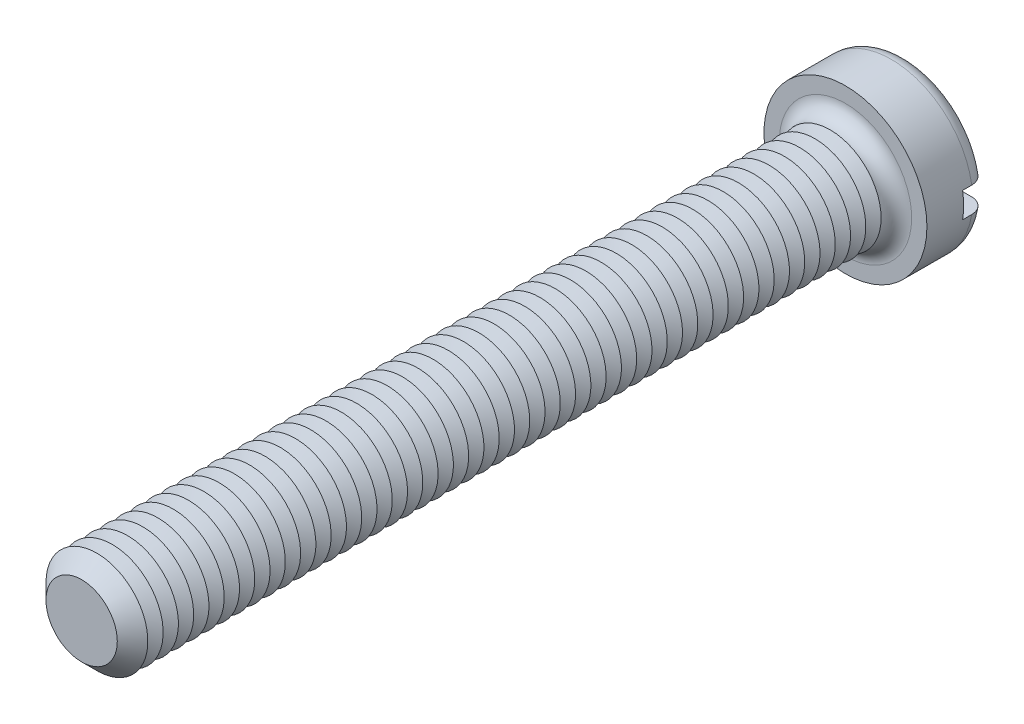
ISO-10303-21;
HEADER;
FILE_DESCRIPTION(('STEP AP214'),'2;1');
FILE_NAME('part.step','',(''),(''),'','','');
FILE_SCHEMA(('AUTOMOTIVE_DESIGN { 1 0 10303 214 1 1 1 1 }'));
ENDSEC;
DATA;
#1=APPLICATION_CONTEXT('core data for automotive mechanical design processes');
#2=APPLICATION_PROTOCOL_DEFINITION('international standard','automotive_design',2000,#1);
#3=PRODUCT_CONTEXT('',#1,'mechanical');
#4=PRODUCT('Part','Part','',(#3));
#5=PRODUCT_RELATED_PRODUCT_CATEGORY('part','',(#4));
#6=PRODUCT_DEFINITION_FORMATION('','',#4);
#7=PRODUCT_DEFINITION_CONTEXT('part definition',#1,'design');
#8=PRODUCT_DEFINITION('design','',#6,#7);
#9=PRODUCT_DEFINITION_SHAPE('','',#8);
#10=(LENGTH_UNIT() NAMED_UNIT(*) SI_UNIT(.MILLI.,.METRE.));
#11=(NAMED_UNIT(*) PLANE_ANGLE_UNIT() SI_UNIT($,.RADIAN.));
#12=(NAMED_UNIT(*) SI_UNIT($,.STERADIAN.) SOLID_ANGLE_UNIT());
#13=UNCERTAINTY_MEASURE_WITH_UNIT(LENGTH_MEASURE(1.E-05),#10,'distance_accuracy_value','');
#14=(GEOMETRIC_REPRESENTATION_CONTEXT(3) GLOBAL_UNCERTAINTY_ASSIGNED_CONTEXT((#13)) GLOBAL_UNIT_ASSIGNED_CONTEXT((#10,
#11,#12)) REPRESENTATION_CONTEXT('',''));
#15=CARTESIAN_POINT('',(0.,0.,0.));
#16=DIRECTION('',(0.,0.,1.));
#17=DIRECTION('',(1.,0.,0.));
#18=AXIS2_PLACEMENT_3D('',#15,#16,#17);
#19=CARTESIAN_POINT('',(0.,0.,-6.));
#20=DIRECTION('',(0.,0.,1.));
#21=DIRECTION('',(1.,0.,0.));
#22=AXIS2_PLACEMENT_3D('',#19,#20,#21);
#23=PLANE('',#22);
#24=CARTESIAN_POINT('',(0.,0.,-6.));
#25=DIRECTION('',(0.,0.,1.));
#26=DIRECTION('',(1.,0.,0.));
#27=AXIS2_PLACEMENT_3D('',#24,#25,#26);
#28=CIRCLE('',#27,6.5);
#29=CARTESIAN_POINT('',(-6.37867541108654,1.25,-6.));
#30=VERTEX_POINT('',#29);
#31=CARTESIAN_POINT('',(6.37867541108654,1.25,-6.));
#32=VERTEX_POINT('',#31);
#33=EDGE_CURVE('E116',#30,#32,#28,.F.);
#34=ORIENTED_EDGE('',*,*,#33,.T.);
#35=DIRECTION('',(1.,0.,0.));
#36=VECTOR('',#35,1.);
#37=CARTESIAN_POINT('',(-8.,1.25,-6.));
#38=LINE('',#37,#36);
#39=EDGE_CURVE('E111',#30,#32,#38,.T.);
#40=ORIENTED_EDGE('',*,*,#39,.F.);
#41=EDGE_LOOP('',(#34,#40));
#42=FACE_BOUND('',#41,.T.);
#43=ADVANCED_FACE('F39',(#42),#23,.F.);
#44=CARTESIAN_POINT('',(0.,0.,-4.5));
#45=DIRECTION('',(0.,0.,1.));
#46=DIRECTION('',(1.,0.,0.));
#47=AXIS2_PLACEMENT_3D('',#44,#45,#46);
#48=TOROIDAL_SURFACE('',#47,6.5,1.5);
#49=CARTESIAN_POINT('',(-7.63778128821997,1.25,-5.34492908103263));
#50=CARTESIAN_POINT('',(-7.58949199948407,1.25,-5.41482553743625));
#51=CARTESIAN_POINT('',(-7.53520056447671,1.25,-5.48065698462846));
#52=CARTESIAN_POINT('',(-7.41624971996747,1.25,-5.60228223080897));
#53=CARTESIAN_POINT('',(-7.35157642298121,1.25,-5.65806236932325));
#54=CARTESIAN_POINT('',(-7.21387612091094,1.25,-5.75795436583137));
#55=CARTESIAN_POINT('',(-7.14085828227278,1.25,-5.80207885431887));
#56=CARTESIAN_POINT('',(-6.98853766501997,1.25,-5.87758013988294));
#57=CARTESIAN_POINT('',(-6.90923642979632,1.25,-5.90896005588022));
#58=CARTESIAN_POINT('',(-6.74565677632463,1.25,-5.95849861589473));
#59=CARTESIAN_POINT('',(-6.66133328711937,1.25,-5.97650838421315));
#60=CARTESIAN_POINT('',(-6.49086565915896,1.25,-5.99833509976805));
#61=CARTESIAN_POINT('',(-6.40472129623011,1.25,-6.00215028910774));
#62=CARTESIAN_POINT('',(-6.23174891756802,1.25,-5.99550457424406));
#63=CARTESIAN_POINT('',(-6.14492874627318,1.25,-5.98483870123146));
#64=CARTESIAN_POINT('',(-5.97427268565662,1.25,-5.94920077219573));
#65=CARTESIAN_POINT('',(-5.89043699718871,1.25,-5.92422775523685));
#66=CARTESIAN_POINT('',(-5.72747580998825,1.25,-5.86041051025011));
#67=CARTESIAN_POINT('',(-5.64839123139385,1.25,-5.8214616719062));
#68=CARTESIAN_POINT('',(-5.49793182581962,1.25,-5.73076137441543));
#69=CARTESIAN_POINT('',(-5.42655700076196,1.25,-5.6790099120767));
#70=CARTESIAN_POINT('',(-5.29410028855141,1.25,-5.56444713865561));
#71=CARTESIAN_POINT('',(-5.23295591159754,1.25,-5.50170815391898));
#72=CARTESIAN_POINT('',(-5.12236155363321,1.25,-5.36664720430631));
#73=CARTESIAN_POINT('',(-5.07291010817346,1.25,-5.29432644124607));
#74=CARTESIAN_POINT('',(-4.98836421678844,1.25,-5.14389152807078));
#75=CARTESIAN_POINT('',(-4.95296843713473,1.25,-5.0659468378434));
#76=CARTESIAN_POINT('',(-4.89620356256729,1.25,-4.90510804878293));
#77=CARTESIAN_POINT('',(-4.87483169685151,1.25,-4.82221493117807));
#78=CARTESIAN_POINT('',(-4.8472995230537,1.25,-4.65636387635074));
#79=CARTESIAN_POINT('',(-4.84072446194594,1.25,-4.57347463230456));
#80=CARTESIAN_POINT('',(-4.84179430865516,1.25,-4.40779255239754));
#81=CARTESIAN_POINT('',(-4.84943782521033,1.25,-4.32499970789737));
#82=CARTESIAN_POINT('',(-4.87846819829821,1.25,-4.16301415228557));
#83=CARTESIAN_POINT('',(-4.89966978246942,1.25,-4.08378809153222));
#84=CARTESIAN_POINT('',(-4.95491528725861,1.25,-3.92995334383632));
#85=CARTESIAN_POINT('',(-4.98895983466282,1.25,-3.85534488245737));
#86=CARTESIAN_POINT('',(-5.06928242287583,1.25,-3.71183790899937));
#87=CARTESIAN_POINT('',(-5.11570495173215,1.25,-3.64302036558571));
#88=CARTESIAN_POINT('',(-5.21915370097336,1.25,-3.51388372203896));
#89=CARTESIAN_POINT('',(-5.27618132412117,1.25,-3.45356574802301));
#90=CARTESIAN_POINT('',(-5.40090076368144,1.25,-3.34137671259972));
#91=CARTESIAN_POINT('',(-5.46884305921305,1.25,-3.28978408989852));
#92=CARTESIAN_POINT('',(-5.61225757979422,1.25,-3.19841811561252));
#93=CARTESIAN_POINT('',(-5.68773079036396,1.25,-3.15864631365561));
#94=CARTESIAN_POINT('',(-5.84602026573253,1.25,-3.09111626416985));
#95=CARTESIAN_POINT('',(-5.92896901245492,1.25,-3.06366820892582));
#96=CARTESIAN_POINT('',(-6.09827849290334,1.25,-3.02294686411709));
#97=CARTESIAN_POINT('',(-6.18463944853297,1.25,-3.00967449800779));
#98=CARTESIAN_POINT('',(-6.35914138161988,1.25,-2.99765063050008));
#99=CARTESIAN_POINT('',(-6.4472913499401,1.25,-2.99902877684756));
#100=CARTESIAN_POINT('',(-6.62209547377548,1.25,-3.01665363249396));
#101=CARTESIAN_POINT('',(-6.70874965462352,1.25,-3.03290008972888));
#102=CARTESIAN_POINT('',(-6.87754008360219,1.25,-3.07975247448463));
#103=CARTESIAN_POINT('',(-6.95969991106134,1.25,-3.11027336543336));
#104=CARTESIAN_POINT('',(-7.11762200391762,1.25,-3.18486653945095));
#105=CARTESIAN_POINT('',(-7.19338469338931,1.25,-3.22893792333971));
#106=CARTESIAN_POINT('',(-7.33522754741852,1.25,-3.32873457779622));
#107=CARTESIAN_POINT('',(-7.40142768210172,1.25,-3.38428930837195));
#108=CARTESIAN_POINT('',(-7.52338344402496,1.25,-3.50587739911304));
#109=CARTESIAN_POINT('',(-7.5791399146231,1.25,-3.57190991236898));
#110=CARTESIAN_POINT('',(-7.67774856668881,1.25,-3.71151097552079));
#111=CARTESIAN_POINT('',(-7.72078137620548,1.25,-3.7849519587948));
#112=CARTESIAN_POINT('',(-7.79373860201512,1.25,-3.93807617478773));
#113=CARTESIAN_POINT('',(-7.82366445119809,1.25,-4.01775872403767));
#114=CARTESIAN_POINT('',(-7.86922494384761,1.25,-4.1801114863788));
#115=CARTESIAN_POINT('',(-7.88502105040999,1.25,-4.26273642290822));
#116=CARTESIAN_POINT('',(-7.90243332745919,1.25,-4.42948977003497));
#117=CARTESIAN_POINT('',(-7.90404643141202,1.25,-4.51361850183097));
#118=CARTESIAN_POINT('',(-7.89306914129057,1.25,-4.68049925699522));
#119=CARTESIAN_POINT('',(-7.88055163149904,1.25,-4.76325613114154));
#120=CARTESIAN_POINT('',(-7.84181179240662,1.25,-4.92542124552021));
#121=CARTESIAN_POINT('',(-7.81560657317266,1.25,-5.00483353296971));
#122=CARTESIAN_POINT('',(-7.76329893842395,1.25,-5.12766777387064));
#123=CARTESIAN_POINT('',(-7.74127773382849,1.25,-5.17287245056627));
#124=CARTESIAN_POINT('',(-7.69279783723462,1.25,-5.26083500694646));
#125=CARTESIAN_POINT('',(-7.66633917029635,1.25,-5.30359290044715));
#126=CARTESIAN_POINT('',(-7.63778128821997,1.25,-5.34492908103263));
#127=B_SPLINE_CURVE_WITH_KNOTS('',3,(#49,#50,#51,#52,#53,#54,#55,#56,#57,#58,#59,#60,#61,#62,
#63,#64,#65,#66,#67,#68,#69,#70,#71,#72,#73,#74,#75,#76,#77,#78,#79,#80,#81,#82,#83,#84,#85,#86,
#87,#88,#89,#90,#91,#92,#93,#94,#95,#96,#97,#98,#99,#100,#101,#102,#103,#104,#105,#106,#107,
#108,#109,#110,#111,#112,#113,#114,#115,#116,#117,#118,#119,#120,#121,#122,#123,#124,#125,#126),
.UNSPECIFIED.,.T.,.F.,(4,2,2,2,2,2,2,2,2,2,2,2,2,2,2,2,2,2,2,2,2,2,2,2,2,2,2,2,2,2,2,2,2,2,2,2,
2,2,4),(0.,0.254678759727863,0.509701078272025,0.764445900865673,1.01912834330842,
1.27660578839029,1.53411511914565,1.7953075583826,2.05651754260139,2.31972495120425,
2.58293242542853,2.84446831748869,3.10597143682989,3.36151874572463,3.61701554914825,
3.86525656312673,4.11347328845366,4.35836855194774,4.60327576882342,4.8511774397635,
5.0991119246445,5.35387584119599,5.60867314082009,5.86956650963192,6.13047687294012,
6.39369803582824,6.65691473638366,6.91858297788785,7.18023385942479,7.43824706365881,
7.69623942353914,7.95037087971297,8.20447454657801,8.45563599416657,8.70685174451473,
8.95677764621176,9.20639187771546,9.35700761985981,9.50762251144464),.UNSPECIFIED.);
#128=CARTESIAN_POINT('',(-7.90174031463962,1.25,-4.50000000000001));
#129=VERTEX_POINT('',#128);
#130=EDGE_CURVE('E563',#129,#30,#127,.T.);
#131=ORIENTED_EDGE('',*,*,#130,.F.);
#132=CARTESIAN_POINT('',(0.,0.,-4.5));
#133=DIRECTION('',(0.,0.,1.));
#134=DIRECTION('',(1.,0.,0.));
#135=AXIS2_PLACEMENT_3D('',#132,#133,#134);
#136=CIRCLE('',#135,8.);
#137=CARTESIAN_POINT('',(7.90174031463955,1.25,-4.5));
#138=VERTEX_POINT('',#137);
#139=EDGE_CURVE('E125',#138,#129,#136,.T.);
#140=ORIENTED_EDGE('',*,*,#139,.F.);
#141=CARTESIAN_POINT('',(4.95236709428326,1.25,-5.05808354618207));
#142=CARTESIAN_POINT('',(4.98477386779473,1.25,-5.13646278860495));
#143=CARTESIAN_POINT('',(5.02397623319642,1.25,-5.21210974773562));
#144=CARTESIAN_POINT('',(5.11464829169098,1.25,-5.35575180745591));
#145=CARTESIAN_POINT('',(5.16613670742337,1.25,-5.42373499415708));
#146=CARTESIAN_POINT('',(5.27963080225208,1.25,-5.55005899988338));
#147=CARTESIAN_POINT('',(5.34161871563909,1.25,-5.60841578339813));
#148=CARTESIAN_POINT('',(5.47431803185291,1.25,-5.71412381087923));
#149=CARTESIAN_POINT('',(5.545027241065,1.25,-5.76147781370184));
#150=CARTESIAN_POINT('',(5.69469818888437,1.25,-5.84486022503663));
#151=CARTESIAN_POINT('',(5.77379661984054,1.25,-5.88064336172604));
#152=CARTESIAN_POINT('',(5.93682776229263,1.25,-5.93863952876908));
#153=CARTESIAN_POINT('',(6.02076112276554,1.25,-5.96085073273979));
#154=CARTESIAN_POINT('',(6.19235911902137,1.25,-5.99130732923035));
#155=CARTESIAN_POINT('',(6.2800597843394,1.25,-5.99935025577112));
#156=CARTESIAN_POINT('',(6.45556807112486,1.25,-6.00057400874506));
#157=CARTESIAN_POINT('',(6.54337569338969,1.25,-5.99375472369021));
#158=CARTESIAN_POINT('',(6.71642471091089,1.25,-5.96539034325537));
#159=CARTESIAN_POINT('',(6.8016703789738,1.25,-5.94387137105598));
#160=CARTESIAN_POINT('',(6.96726399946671,1.25,-5.8866508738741));
#161=CARTESIAN_POINT('',(7.04761223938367,1.25,-5.85095018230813));
#162=CARTESIAN_POINT('',(7.2000703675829,1.25,-5.7668235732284));
#163=CARTESIAN_POINT('',(7.27226868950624,1.25,-5.71855796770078));
#164=CARTESIAN_POINT('',(7.40737382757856,1.25,-5.61041520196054));
#165=CARTESIAN_POINT('',(7.47028138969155,1.25,-5.55053897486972));
#166=CARTESIAN_POINT('',(7.5840004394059,1.25,-5.42185995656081));
#167=CARTESIAN_POINT('',(7.63498189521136,1.25,-5.35320736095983));
#168=CARTESIAN_POINT('',(7.72451646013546,1.25,-5.20822613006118));
#169=CARTESIAN_POINT('',(7.76307051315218,1.25,-5.13189807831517));
#170=CARTESIAN_POINT('',(7.82615156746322,1.25,-4.97479919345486));
#171=CARTESIAN_POINT('',(7.85085353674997,1.25,-4.89409858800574));
#172=CARTESIAN_POINT('',(7.88624162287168,1.25,-4.72968126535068));
#173=CARTESIAN_POINT('',(7.89692844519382,1.25,-4.64596470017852));
#174=CARTESIAN_POINT('',(7.90393395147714,1.25,-4.47857496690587));
#175=CARTESIAN_POINT('',(7.900361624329,1.25,-4.39490633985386));
#176=CARTESIAN_POINT('',(7.8792027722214,1.25,-4.22936201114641));
#177=CARTESIAN_POINT('',(7.86161649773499,1.25,-4.14748627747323));
#178=CARTESIAN_POINT('',(7.81298565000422,1.25,-3.98793539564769));
#179=CARTESIAN_POINT('',(7.78195585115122,1.25,-3.91025574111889));
#180=CARTESIAN_POINT('',(7.70736418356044,1.25,-3.76116938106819));
#181=CARTESIAN_POINT('',(7.66380211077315,1.25,-3.68976277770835));
#182=CARTESIAN_POINT('',(7.56515173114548,1.25,-3.55480889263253));
#183=CARTESIAN_POINT('',(7.51000119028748,1.25,-3.49130712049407));
#184=CARTESIAN_POINT('',(7.38992820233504,1.25,-3.3743390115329));
#185=CARTESIAN_POINT('',(7.32500529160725,1.25,-3.32087315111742));
#186=CARTESIAN_POINT('',(7.18646521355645,1.25,-3.22483712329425));
#187=CARTESIAN_POINT('',(7.11275872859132,1.25,-3.18239583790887));
#188=CARTESIAN_POINT('',(6.95934489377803,1.25,-3.11028530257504));
#189=CARTESIAN_POINT('',(6.87963710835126,1.25,-3.08061698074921));
#190=CARTESIAN_POINT('',(6.71523243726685,1.25,-3.03442872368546));
#191=CARTESIAN_POINT('',(6.63047940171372,1.25,-3.0181086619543));
#192=CARTESIAN_POINT('',(6.45944163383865,1.25,-2.99971307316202));
#193=CARTESIAN_POINT('',(6.37315677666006,1.25,-2.99763871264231));
#194=CARTESIAN_POINT('',(6.20021063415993,1.25,-3.00779604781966));
#195=CARTESIAN_POINT('',(6.11356117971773,1.25,-3.02022976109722));
#196=CARTESIAN_POINT('',(5.94354092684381,1.25,-3.05935975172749));
#197=CARTESIAN_POINT('',(5.86017035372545,1.25,-3.08605700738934));
#198=CARTESIAN_POINT('',(5.69848536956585,1.25,-3.15322746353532));
#199=CARTESIAN_POINT('',(5.62021039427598,1.25,-3.1937956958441));
#200=CARTESIAN_POINT('',(5.47164170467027,1.25,-3.28758816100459));
#201=CARTESIAN_POINT('',(5.40134797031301,1.25,-3.3408123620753));
#202=CARTESIAN_POINT('',(5.27136483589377,1.25,-3.45806317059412));
#203=CARTESIAN_POINT('',(5.21160120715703,1.25,-3.52200740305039));
#204=CARTESIAN_POINT('',(5.10396941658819,1.25,-3.65922833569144));
#205=CARTESIAN_POINT('',(5.05609917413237,1.25,-3.73250340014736));
#206=CARTESIAN_POINT('',(4.97487058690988,1.25,-3.8844714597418));
#207=CARTESIAN_POINT('',(4.94119529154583,1.25,-3.96299495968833));
#208=CARTESIAN_POINT('',(4.88793322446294,1.25,-4.12470694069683));
#209=CARTESIAN_POINT('',(4.86834741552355,1.25,-4.20789574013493));
#210=CARTESIAN_POINT('',(4.84433446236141,1.25,-4.3740749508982));
#211=CARTESIAN_POINT('',(4.83950391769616,1.25,-4.45700748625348));
#212=CARTESIAN_POINT('',(4.84404021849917,1.25,-4.62240731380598));
#213=CARTESIAN_POINT('',(4.85338770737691,1.25,-4.70487508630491));
#214=CARTESIAN_POINT('',(4.87895619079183,1.25,-4.83246978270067));
#215=CARTESIAN_POINT('',(4.89056704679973,1.25,-4.87856970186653));
#216=CARTESIAN_POINT('',(4.91819711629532,1.25,-4.96942661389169));
#217=CARTESIAN_POINT('',(4.93421619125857,1.25,-5.01418364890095));
#218=CARTESIAN_POINT('',(4.95236709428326,1.25,-5.05808354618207));
#219=B_SPLINE_CURVE_WITH_KNOTS('',3,(#141,#142,#143,#144,#145,#146,#147,#148,#149,#150,#151,
#152,#153,#154,#155,#156,#157,#158,#159,#160,#161,#162,#163,#164,#165,#166,#167,#168,#169,#170,
#171,#172,#173,#174,#175,#176,#177,#178,#179,#180,#181,#182,#183,#184,#185,#186,#187,#188,#189,
#190,#191,#192,#193,#194,#195,#196,#197,#198,#199,#200,#201,#202,#203,#204,#205,#206,#207,#208,
#209,#210,#211,#212,#213,#214,#215,#216,#217,#218),.UNSPECIFIED.,.T.,.F.,(4,2,2,2,2,2,2,2,2,2,2,
2,2,2,2,2,2,2,2,2,2,2,2,2,2,2,2,2,2,2,2,2,2,2,2,2,2,2,4),(0.,0.25426396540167,0.508917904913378,
0.763145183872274,1.01730864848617,1.27655188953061,1.53583000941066,1.79878406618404,
2.06174009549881,2.32423003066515,2.5867045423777,2.84598168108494,3.10523799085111,
3.36053725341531,3.61581712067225,3.8677953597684,4.11976091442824,4.36980428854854,
4.61984319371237,4.86960800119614,5.11937687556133,5.37052303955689,5.62168112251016,
5.87565515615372,6.12964764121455,6.38737709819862,6.64512765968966,6.90651052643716,
7.16791132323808,7.43114013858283,7.69436829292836,7.95565940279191,8.21690477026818,
8.47196060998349,8.72703387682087,8.97506819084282,9.22276418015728,9.36518087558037,
9.50759309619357),.UNSPECIFIED.);
#220=EDGE_CURVE('E565',#32,#138,#219,.T.);
#221=ORIENTED_EDGE('',*,*,#220,.F.);
#222=ORIENTED_EDGE('',*,*,#33,.F.);
#223=EDGE_LOOP('',(#131,#140,#221,#222));
#224=FACE_BOUND('',#223,.T.);
#225=ADVANCED_FACE('F547',(#224),#48,.T.);
#226=CARTESIAN_POINT('',(0.,0.,-6.));
#227=DIRECTION('',(0.,0.,1.));
#228=DIRECTION('',(1.,0.,0.));
#229=AXIS2_PLACEMENT_3D('',#226,#227,#228);
#230=CYLINDRICAL_SURFACE('',#229,8.);
#231=DIRECTION('',(0.,0.,1.));
#232=VECTOR('',#231,1.);
#233=CARTESIAN_POINT('',(7.90174031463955,1.25,-6.));
#234=LINE('',#233,#232);
#235=CARTESIAN_POINT('',(7.90174031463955,1.25,-3.6));
#236=VERTEX_POINT('',#235);
#237=EDGE_CURVE('E579',#138,#236,#234,.T.);
#238=ORIENTED_EDGE('',*,*,#237,.F.);
#239=ORIENTED_EDGE('',*,*,#139,.T.);
#240=DIRECTION('',(0.,0.,1.));
#241=VECTOR('',#240,1.);
#242=CARTESIAN_POINT('',(-7.90174031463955,1.25,-6.));
#243=LINE('',#242,#241);
#244=CARTESIAN_POINT('',(-7.90174031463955,1.25,-3.6));
#245=VERTEX_POINT('',#244);
#246=EDGE_CURVE('E63',#245,#129,#243,.F.);
#247=ORIENTED_EDGE('',*,*,#246,.F.);
#248=CARTESIAN_POINT('',(0.,0.,-3.6));
#249=DIRECTION('',(0.,0.,-1.));
#250=DIRECTION('',(-1.,0.,0.));
#251=AXIS2_PLACEMENT_3D('',#248,#249,#250);
#252=CIRCLE('',#251,8.);
#253=CARTESIAN_POINT('',(-7.90174031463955,-1.25,-3.6));
#254=VERTEX_POINT('',#253);
#255=EDGE_CURVE('E43',#245,#254,#252,.F.);
#256=ORIENTED_EDGE('',*,*,#255,.T.);
#257=DIRECTION('',(0.,0.,1.));
#258=VECTOR('',#257,1.);
#259=CARTESIAN_POINT('',(-7.90174031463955,-1.25,-6.));
#260=LINE('',#259,#258);
#261=CARTESIAN_POINT('',(-7.9017403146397,-1.25,-4.49999999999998));
#262=VERTEX_POINT('',#261);
#263=EDGE_CURVE('E576',#262,#254,#260,.T.);
#264=ORIENTED_EDGE('',*,*,#263,.F.);
#265=CARTESIAN_POINT('',(7.90174031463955,-1.25,-4.5));
#266=VERTEX_POINT('',#265);
#267=EDGE_CURVE('E127',#262,#266,#136,.T.);
#268=ORIENTED_EDGE('',*,*,#267,.T.);
#269=DIRECTION('',(0.,0.,1.));
#270=VECTOR('',#269,1.);
#271=CARTESIAN_POINT('',(7.90174031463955,-1.25,-6.));
#272=LINE('',#271,#270);
#273=CARTESIAN_POINT('',(7.90174031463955,-1.25,-3.6));
#274=VERTEX_POINT('',#273);
#275=EDGE_CURVE('E55',#274,#266,#272,.F.);
#276=ORIENTED_EDGE('',*,*,#275,.F.);
#277=EDGE_CURVE('E11',#274,#236,#252,.F.);
#278=ORIENTED_EDGE('',*,*,#277,.T.);
#279=EDGE_LOOP('',(#238,#239,#247,#256,#264,#268,#276,#278));
#280=FACE_BOUND('',#279,.T.);
#281=CARTESIAN_POINT('',(0.,0.,0.));
#282=DIRECTION('',(0.,0.,1.));
#283=DIRECTION('',(1.,0.,0.));
#284=AXIS2_PLACEMENT_3D('',#281,#282,#283);
#285=CIRCLE('',#284,8.);
#286=CARTESIAN_POINT('',(8.,0.,0.));
#287=VERTEX_POINT('',#286);
#288=EDGE_CURVE('E582',#287,#287,#285,.T.);
#289=ORIENTED_EDGE('',*,*,#288,.F.);
#290=EDGE_LOOP('',(#289));
#291=FACE_BOUND('',#290,.T.);
#292=ADVANCED_FACE('F543',(#280,#291),#230,.T.);
#293=CARTESIAN_POINT('',(6.37867541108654,-1.25,-6.));
#294=VERTEX_POINT('',#293);
#295=CARTESIAN_POINT('',(-6.37867541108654,-1.25,-6.));
#296=VERTEX_POINT('',#295);
#297=EDGE_CURVE('E109',#294,#296,#28,.F.);
#298=ORIENTED_EDGE('',*,*,#297,.T.);
#299=DIRECTION('',(-1.,0.,0.));
#300=VECTOR('',#299,1.);
#301=CARTESIAN_POINT('',(-8.,-1.25,-6.));
#302=LINE('',#301,#300);
#303=EDGE_CURVE('E96',#294,#296,#302,.T.);
#304=ORIENTED_EDGE('',*,*,#303,.F.);
#305=EDGE_LOOP('',(#298,#304));
#306=FACE_BOUND('',#305,.T.);
#307=ADVANCED_FACE('F108',(#306),#23,.F.);
#308=CARTESIAN_POINT('',(0.,0.,0.));
#309=DIRECTION('',(0.,0.,1.));
#310=DIRECTION('',(1.,0.,0.));
#311=AXIS2_PLACEMENT_3D('',#308,#309,#310);
#312=PLANE('',#311);
#313=CARTESIAN_POINT('',(0.,0.,0.));
#314=DIRECTION('',(0.,0.,1.));
#315=DIRECTION('',(1.,0.,0.));
#316=AXIS2_PLACEMENT_3D('',#313,#314,#315);
#317=CIRCLE('',#316,6.5);
#318=CARTESIAN_POINT('',(6.5,0.,0.));
#319=VERTEX_POINT('',#318);
#320=EDGE_CURVE('E115',#319,#319,#317,.F.);
#321=ORIENTED_EDGE('',*,*,#320,.T.);
#322=EDGE_LOOP('',(#321));
#323=FACE_BOUND('',#322,.T.);
#324=ORIENTED_EDGE('',*,*,#288,.T.);
#325=EDGE_LOOP('',(#324));
#326=FACE_BOUND('',#325,.T.);
#327=ADVANCED_FACE('F542',(#323,#326),#312,.T.);
#328=CARTESIAN_POINT('',(-7.63778128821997,-1.25,-5.34492908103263));
#329=CARTESIAN_POINT('',(-7.68527581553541,-1.25,-5.27616964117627));
#330=CARTESIAN_POINT('',(-7.72703224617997,-1.25,-5.20337764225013));
#331=CARTESIAN_POINT('',(-7.79778035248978,-1.25,-5.05176511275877));
#332=CARTESIAN_POINT('',(-7.82675823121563,-1.25,-4.97293817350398));
#333=CARTESIAN_POINT('',(-7.87103239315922,-1.25,-4.81153865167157));
#334=CARTESIAN_POINT('',(-7.8863313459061,-1.25,-4.72896680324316));
#335=CARTESIAN_POINT('',(-7.90278562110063,-1.25,-4.56244566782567));
#336=CARTESIAN_POINT('',(-7.90394420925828,-1.25,-4.4784967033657));
#337=CARTESIAN_POINT('',(-7.89211470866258,-1.25,-4.31190980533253));
#338=CARTESIAN_POINT('',(-7.87917806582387,-1.25,-4.22926821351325));
#339=CARTESIAN_POINT('',(-7.8396278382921,-1.25,-4.06732477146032));
#340=CARTESIAN_POINT('',(-7.81301388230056,-1.25,-3.98802301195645));
#341=CARTESIAN_POINT('',(-7.74686575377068,-1.25,-3.83490116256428));
#342=CARTESIAN_POINT('',(-7.70731700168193,-1.25,-3.76108737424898));
#343=CARTESIAN_POINT('',(-7.61647675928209,-1.25,-3.62108231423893));
#344=CARTESIAN_POINT('',(-7.56518496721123,-1.25,-3.55489123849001));
#345=CARTESIAN_POINT('',(-7.45192141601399,-1.25,-3.43145488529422));
#346=CARTESIAN_POINT('',(-7.3898717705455,-1.25,-3.37428109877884));
#347=CARTESIAN_POINT('',(-7.25715883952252,-1.25,-3.27100737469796));
#348=CARTESIAN_POINT('',(-7.18649507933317,-1.25,-3.22490804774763));
#349=CARTESIAN_POINT('',(-7.03760898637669,-1.25,-3.14445316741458));
#350=CARTESIAN_POINT('',(-6.95930204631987,-1.25,-3.1102542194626));
#351=CARTESIAN_POINT('',(-6.79811453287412,-1.25,-3.05526915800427));
#352=CARTESIAN_POINT('',(-6.71523359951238,-1.25,-3.03448410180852));
#353=CARTESIAN_POINT('',(-6.5459165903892,-1.25,-3.006592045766));
#354=CARTESIAN_POINT('',(-6.45944575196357,-1.25,-2.99969602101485));
#355=CARTESIAN_POINT('',(-6.28655568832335,-1.25,-3.00032465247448));
#356=CARTESIAN_POINT('',(-6.20013646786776,-1.25,-3.00785047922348));
#357=CARTESIAN_POINT('',(-6.02865505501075,-1.25,-3.03725742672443));
#358=CARTESIAN_POINT('',(-5.94362352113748,-1.25,-3.05931758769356));
#359=CARTESIAN_POINT('',(-5.77844448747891,-1.25,-3.11735373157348));
#360=CARTESIAN_POINT('',(-5.69829723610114,-1.25,-3.15333042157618));
#361=CARTESIAN_POINT('',(-5.54495924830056,-1.25,-3.23837037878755));
#362=CARTESIAN_POINT('',(-5.47178958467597,-1.25,-3.28747168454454));
#363=CARTESIAN_POINT('',(-5.33486536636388,-1.25,-3.39741183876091));
#364=CARTESIAN_POINT('',(-5.27111040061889,-1.25,-3.45825017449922));
#365=CARTESIAN_POINT('',(-5.15579778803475,-1.25,-3.58914722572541));
#366=CARTESIAN_POINT('',(-5.10409113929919,-1.25,-3.65907455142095));
#367=CARTESIAN_POINT('',(-5.01353659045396,-1.25,-3.8068142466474));
#368=CARTESIAN_POINT('',(-4.97468647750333,-1.25,-3.88462525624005));
#369=CARTESIAN_POINT('',(-4.91208858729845,-1.25,-4.04366636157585));
#370=CARTESIAN_POINT('',(-4.88795969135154,-1.25,-4.12474643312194));
#371=CARTESIAN_POINT('',(-4.85404909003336,-1.25,-4.28985038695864));
#372=CARTESIAN_POINT('',(-4.84426486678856,-1.25,-4.37387374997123));
#373=CARTESIAN_POINT('',(-4.83946276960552,-1.25,-4.54023897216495));
#374=CARTESIAN_POINT('',(-4.8440833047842,-1.25,-4.62257060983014));
#375=CARTESIAN_POINT('',(-4.86713763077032,-1.25,-4.78527148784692));
#376=CARTESIAN_POINT('',(-4.88557092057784,-1.25,-4.86564079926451));
#377=CARTESIAN_POINT('',(-4.9355229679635,-1.25,-5.02189555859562));
#378=CARTESIAN_POINT('',(-4.9669975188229,-1.25,-5.09779517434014));
#379=CARTESIAN_POINT('',(-5.04199393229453,-1.25,-5.24338322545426));
#380=CARTESIAN_POINT('',(-5.0855168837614,-1.25,-5.31307109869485));
#381=CARTESIAN_POINT('',(-5.18427540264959,-1.25,-5.44580979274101));
#382=CARTESIAN_POINT('',(-5.2397318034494,-1.25,-5.50869620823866));
#383=CARTESIAN_POINT('',(-5.36015301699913,-1.25,-5.62458635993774));
#384=CARTESIAN_POINT('',(-5.42511919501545,-1.25,-5.67758867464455));
#385=CARTESIAN_POINT('',(-5.56469412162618,-1.25,-5.7737610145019));
#386=CARTESIAN_POINT('',(-5.6395232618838,-1.25,-5.81661133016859));
#387=CARTESIAN_POINT('',(-5.79521544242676,-1.25,-5.8894110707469));
#388=CARTESIAN_POINT('',(-5.8760791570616,-1.25,-5.91935905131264));
#389=CARTESIAN_POINT('',(-6.04317815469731,-1.25,-5.9660059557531));
#390=CARTESIAN_POINT('',(-6.12948555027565,-1.25,-5.98244700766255));
#391=CARTESIAN_POINT('',(-6.30363462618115,-1.25,-6.00064866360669));
#392=CARTESIAN_POINT('',(-6.39147629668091,-1.25,-6.00240936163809));
#393=CARTESIAN_POINT('',(-6.5664192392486,-1.25,-5.9911248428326));
#394=CARTESIAN_POINT('',(-6.653518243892,-1.25,-5.9780442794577));
#395=CARTESIAN_POINT('',(-6.82426167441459,-1.25,-5.93729204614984));
#396=CARTESIAN_POINT('',(-6.90790538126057,-1.25,-5.90961735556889));
#397=CARTESIAN_POINT('',(-7.06846412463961,-1.25,-5.84071272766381));
#398=CARTESIAN_POINT('',(-7.14543542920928,-1.25,-5.79961377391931));
#399=CARTESIAN_POINT('',(-7.29116896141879,-1.25,-5.70491210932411));
#400=CARTESIAN_POINT('',(-7.35994165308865,-1.25,-5.65132560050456));
#401=CARTESIAN_POINT('',(-7.46362894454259,-1.25,-5.55509815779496));
#402=CARTESIAN_POINT('',(-7.50165191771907,-1.25,-5.51575032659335));
#403=CARTESIAN_POINT('',(-7.57319530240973,-1.25,-5.43315308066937));
#404=CARTESIAN_POINT('',(-7.60671575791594,-1.25,-5.38990370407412));
#405=CARTESIAN_POINT('',(-7.63778128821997,-1.25,-5.34492908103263));
#406=B_SPLINE_CURVE_WITH_KNOTS('',3,(#328,#329,#330,#331,#332,#333,#334,#335,#336,#337,#338,
#339,#340,#341,#342,#343,#344,#345,#346,#347,#348,#349,#350,#351,#352,#353,#354,#355,#356,#357,
#358,#359,#360,#361,#362,#363,#364,#365,#366,#367,#368,#369,#370,#371,#372,#373,#374,#375,#376,
#377,#378,#379,#380,#381,#382,#383,#384,#385,#386,#387,#388,#389,#390,#391,#392,#393,#394,#395,
#396,#397,#398,#399,#400,#401,#402,#403,#404,#405),.UNSPECIFIED.,.T.,.F.,(4,2,2,2,2,2,2,2,2,2,2,
2,2,2,2,2,2,2,2,2,2,2,2,2,2,2,2,2,2,2,2,2,2,2,2,2,2,2,4),(0.,0.250506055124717,
0.501281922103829,0.752008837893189,1.00267784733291,1.25243500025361,1.50219893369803,
1.75224536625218,2.00229822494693,2.25424343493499,2.50620253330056,2.76136198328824,
3.01654154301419,3.27556891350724,3.53461730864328,3.79691797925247,4.05923197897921,
4.32231463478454,4.5853858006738,4.84500678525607,5.10458306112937,5.3571172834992,
5.60960717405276,5.85581050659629,6.10200490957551,6.34737151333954,6.59276029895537,
6.84315522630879,7.09358613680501,7.35108485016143,7.60861238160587,7.87094926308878,
8.13328446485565,8.39624576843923,8.65926152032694,8.91978401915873,9.17997036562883,
9.34382460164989,9.50767723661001),.UNSPECIFIED.);
#407=EDGE_CURVE('E103',#296,#262,#406,.T.);
#408=ORIENTED_EDGE('',*,*,#407,.F.);
#409=ORIENTED_EDGE('',*,*,#297,.F.);
#410=CARTESIAN_POINT('',(4.95236709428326,-1.25,-5.05808354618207));
#411=CARTESIAN_POINT('',(4.92105512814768,-1.25,-4.98233216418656));
#412=CARTESIAN_POINT('',(4.89604361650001,-1.25,-4.90392040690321));
#413=CARTESIAN_POINT('',(4.85951223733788,-1.25,-4.74395758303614));
#414=CARTESIAN_POINT('',(4.8480045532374,-1.25,-4.66240375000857));
#415=CARTESIAN_POINT('',(4.83891469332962,-1.25,-4.49852199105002));
#416=CARTESIAN_POINT('',(4.84133145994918,-1.25,-4.41619412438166));
#417=CARTESIAN_POINT('',(4.8600038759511,-1.25,-4.25314313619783));
#418=CARTESIAN_POINT('',(4.87625705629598,-1.25,-4.17241973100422));
#419=CARTESIAN_POINT('',(4.92196554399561,-1.25,-4.01505032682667));
#420=CARTESIAN_POINT('',(4.95138456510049,-1.25,-3.93839376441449));
#421=CARTESIAN_POINT('',(5.02244158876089,-1.25,-3.79097367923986));
#422=CARTESIAN_POINT('',(5.06408092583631,-1.25,-3.72021080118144));
#423=CARTESIAN_POINT('',(5.15918188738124,-1.25,-3.5851203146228));
#424=CARTESIAN_POINT('',(5.21285223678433,-1.25,-3.5209397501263));
#425=CARTESIAN_POINT('',(5.32993512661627,-1.25,-3.40218700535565));
#426=CARTESIAN_POINT('',(5.39334903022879,-1.25,-3.34761617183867));
#427=CARTESIAN_POINT('',(5.5300552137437,-1.25,-3.24801679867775));
#428=CARTESIAN_POINT('',(5.60357647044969,-1.25,-3.20330242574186));
#429=CARTESIAN_POINT('',(5.75697062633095,-1.25,-3.1265687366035));
#430=CARTESIAN_POINT('',(5.83684424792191,-1.25,-3.09455086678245));
#431=CARTESIAN_POINT('',(6.00239031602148,-1.25,-3.04353393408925));
#432=CARTESIAN_POINT('',(6.08814636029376,-1.25,-3.02480570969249));
#433=CARTESIAN_POINT('',(6.26158564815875,-1.25,-3.00194915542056));
#434=CARTESIAN_POINT('',(6.34926896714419,-1.25,-2.997821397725));
#435=CARTESIAN_POINT('',(6.52441816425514,-1.25,-3.00435236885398));
#436=CARTESIAN_POINT('',(6.61188199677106,-1.25,-3.01506655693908));
#437=CARTESIAN_POINT('',(6.78373130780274,-1.25,-3.05116556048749));
#438=CARTESIAN_POINT('',(6.8681168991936,-1.25,-3.07654983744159));
#439=CARTESIAN_POINT('',(7.03056473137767,-1.25,-3.14105639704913));
#440=CARTESIAN_POINT('',(7.10867812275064,-1.25,-3.18004978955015));
#441=CARTESIAN_POINT('',(7.25711285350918,-1.25,-3.27078804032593));
#442=CARTESIAN_POINT('',(7.327434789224,-1.25,-3.32253192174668));
#443=CARTESIAN_POINT('',(7.45716954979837,-1.25,-3.4364775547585));
#444=CARTESIAN_POINT('',(7.51672925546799,-1.25,-3.49851206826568));
#445=CARTESIAN_POINT('',(7.62440498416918,-1.25,-3.63182557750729));
#446=CARTESIAN_POINT('',(7.67252193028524,-1.25,-3.70310382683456));
#447=CARTESIAN_POINT('',(7.75523498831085,-1.25,-3.8517825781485));
#448=CARTESIAN_POINT('',(7.79001407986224,-1.25,-3.92908131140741));
#449=CARTESIAN_POINT('',(7.84595474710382,-1.25,-4.08845836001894));
#450=CARTESIAN_POINT('',(7.86711715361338,-1.25,-4.1705363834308));
#451=CARTESIAN_POINT('',(7.89503817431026,-1.25,-4.3362768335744));
#452=CARTESIAN_POINT('',(7.90193595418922,-1.25,-4.41991584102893));
#453=CARTESIAN_POINT('',(7.90153623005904,-1.25,-4.58715860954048));
#454=CARTESIAN_POINT('',(7.89423915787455,-1.25,-4.67076237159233));
#455=CARTESIAN_POINT('',(7.86572271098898,-1.25,-4.83525080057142));
#456=CARTESIAN_POINT('',(7.84455307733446,-1.25,-4.91614410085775));
#457=CARTESIAN_POINT('',(7.78897430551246,-1.25,-5.0732444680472));
#458=CARTESIAN_POINT('',(7.75456511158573,-1.25,-5.1494515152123));
#459=CARTESIAN_POINT('',(7.67339923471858,-1.25,-5.29528903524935));
#460=CARTESIAN_POINT('',(7.62660424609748,-1.25,-5.36489817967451));
#461=CARTESIAN_POINT('',(7.52209201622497,-1.25,-5.49536318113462));
#462=CARTESIAN_POINT('',(7.4643743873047,-1.25,-5.55621872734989));
#463=CARTESIAN_POINT('',(7.33909994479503,-1.25,-5.66807257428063));
#464=CARTESIAN_POINT('',(7.27145672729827,-1.25,-5.71897407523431));
#465=CARTESIAN_POINT('',(7.12868060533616,-1.25,-5.80887807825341));
#466=CARTESIAN_POINT('',(7.0535472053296,-1.25,-5.84787979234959));
#467=CARTESIAN_POINT('',(6.89682225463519,-1.25,-5.91345911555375));
#468=CARTESIAN_POINT('',(6.81515596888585,-1.25,-5.93985808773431));
#469=CARTESIAN_POINT('',(6.64858434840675,-1.25,-5.97879449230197));
#470=CARTESIAN_POINT('',(6.56367874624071,-1.25,-5.99133077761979));
#471=CARTESIAN_POINT('',(6.39168259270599,-1.25,-6.00236627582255));
#472=CARTESIAN_POINT('',(6.30457835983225,-1.25,-6.00065255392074));
#473=CARTESIAN_POINT('',(6.13186422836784,-1.25,-5.98278857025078));
#474=CARTESIAN_POINT('',(6.04625438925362,-1.25,-5.96663773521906));
#475=CARTESIAN_POINT('',(5.87802521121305,-1.25,-5.92012173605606));
#476=CARTESIAN_POINT('',(5.79544617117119,-1.25,-5.88961066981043));
#477=CARTESIAN_POINT('',(5.63656223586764,-1.25,-5.81513349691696));
#478=CARTESIAN_POINT('',(5.56025908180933,-1.25,-5.77116367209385));
#479=CARTESIAN_POINT('',(5.4162607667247,-1.25,-5.67098882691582));
#480=CARTESIAN_POINT('',(5.34855795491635,-1.25,-5.61479480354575));
#481=CARTESIAN_POINT('',(5.22382615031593,-1.25,-5.49168804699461));
#482=CARTESIAN_POINT('',(5.16678340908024,-1.25,-5.42478932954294));
#483=CARTESIAN_POINT('',(5.08326589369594,-1.25,-5.3075481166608));
#484=CARTESIAN_POINT('',(5.05313168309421,-1.25,-5.25976959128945));
#485=CARTESIAN_POINT('',(4.99845900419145,-1.25,-5.16110869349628));
#486=CARTESIAN_POINT('',(4.9739204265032,-1.25,-5.11022638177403));
#487=CARTESIAN_POINT('',(4.95236709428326,-1.25,-5.05808354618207));
#488=B_SPLINE_CURVE_WITH_KNOTS('',3,(#410,#411,#412,#413,#414,#415,#416,#417,#418,#419,#420,
#421,#422,#423,#424,#425,#426,#427,#428,#429,#430,#431,#432,#433,#434,#435,#436,#437,#438,#439,
#440,#441,#442,#443,#444,#445,#446,#447,#448,#449,#450,#451,#452,#453,#454,#455,#456,#457,#458,
#459,#460,#461,#462,#463,#464,#465,#466,#467,#468,#469,#470,#471,#472,#473,#474,#475,#476,#477,
#478,#479,#480,#481,#482,#483,#484,#485,#486,#487),.UNSPECIFIED.,.T.,.F.,(4,2,2,2,2,2,2,2,2,2,2,
2,2,2,2,2,2,2,2,2,2,2,2,2,2,2,2,2,2,2,2,2,2,2,2,2,2,2,4),(0.,0.245701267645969,
0.491624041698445,0.737528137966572,0.983388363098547,1.22857510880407,1.47378864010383,
1.72364048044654,1.97352730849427,2.2304941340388,2.48749022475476,2.74958408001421,
3.01168820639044,3.2747743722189,3.53785088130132,3.79850056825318,4.05913029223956,
4.31587819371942,4.57260537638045,4.82567253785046,5.07872425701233,5.32929532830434,
5.57985877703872,5.82952869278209,6.07919966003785,6.32965199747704,6.58011322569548,
6.8329006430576,7.08570479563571,7.3419930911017,7.59830259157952,7.85844887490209,
8.11860548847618,8.38146435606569,8.64439590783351,8.90709189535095,9.16944670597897,
9.33857644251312,9.5077028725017),.UNSPECIFIED.);
#489=EDGE_CURVE('E92',#266,#294,#488,.T.);
#490=ORIENTED_EDGE('',*,*,#489,.F.);
#491=ORIENTED_EDGE('',*,*,#267,.F.);
#492=EDGE_LOOP('',(#408,#409,#490,#491));
#493=FACE_BOUND('',#492,.T.);
#494=ADVANCED_FACE('F113',(#493),#48,.T.);
#495=CARTESIAN_POINT('',(0.,0.,1.5));
#496=DIRECTION('',(0.,0.,1.));
#497=DIRECTION('',(1.,0.,0.));
#498=AXIS2_PLACEMENT_3D('',#495,#496,#497);
#499=TOROIDAL_SURFACE('',#498,6.5,1.5);
#500=ORIENTED_EDGE('',*,*,#320,.F.);
#501=EDGE_LOOP('',(#500));
#502=FACE_BOUND('',#501,.T.);
#503=CARTESIAN_POINT('',(0.,0.,1.5));
#504=DIRECTION('',(0.,0.,-1.));
#505=DIRECTION('',(-1.,0.,0.));
#506=AXIS2_PLACEMENT_3D('',#503,#504,#505);
#507=CIRCLE('',#506,5.);
#508=CARTESIAN_POINT('',(-5.,0.,1.5));
#509=VERTEX_POINT('',#508);
#510=EDGE_CURVE('E588',#509,#509,#507,.T.);
#511=ORIENTED_EDGE('',*,*,#510,.T.);
#512=EDGE_LOOP('',(#511));
#513=FACE_BOUND('',#512,.T.);
#514=ADVANCED_FACE('F535',(#502,#513),#499,.F.);
#515=CARTESIAN_POINT('',(0.,0.,2.25));
#516=DIRECTION('',(0.,0.,-1.));
#517=DIRECTION('',(-1.,0.,0.));
#518=AXIS2_PLACEMENT_3D('',#515,#516,#517);
#519=CONICAL_SURFACE('',#518,3.70096189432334,1.0471975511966);
#520=ORIENTED_EDGE('',*,*,#510,.F.);
#521=EDGE_LOOP('',(#520));
#522=FACE_BOUND('',#521,.T.);
#523=CARTESIAN_POINT('',(0.,0.,2.25));
#524=DIRECTION('',(0.,0.,-1.));
#525=DIRECTION('',(-1.,0.,0.));
#526=AXIS2_PLACEMENT_3D('',#523,#524,#525);
#527=CIRCLE('',#526,3.70096189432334);
#528=CARTESIAN_POINT('',(-3.70096189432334,0.,2.25));
#529=VERTEX_POINT('',#528);
#530=EDGE_CURVE('E594',#529,#529,#527,.T.);
#531=ORIENTED_EDGE('',*,*,#530,.T.);
#532=EDGE_LOOP('',(#531));
#533=FACE_BOUND('',#532,.T.);
#534=ADVANCED_FACE('F531',(#522,#533),#519,.T.);
#535=CARTESIAN_POINT('',(0.,0.,3.));
#536=DIRECTION('',(0.,0.,1.));
#537=DIRECTION('',(1.,0.,0.));
#538=AXIS2_PLACEMENT_3D('',#535,#536,#537);
#539=CONICAL_SURFACE('',#538,5.,1.0471975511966);
#540=ORIENTED_EDGE('',*,*,#530,.F.);
#541=EDGE_LOOP('',(#540));
#542=FACE_BOUND('',#541,.T.);
#543=CARTESIAN_POINT('',(0.,0.,3.));
#544=DIRECTION('',(0.,0.,-1.));
#545=DIRECTION('',(-1.,0.,0.));
#546=AXIS2_PLACEMENT_3D('',#543,#544,#545);
#547=CIRCLE('',#546,5.);
#548=CARTESIAN_POINT('',(-5.,0.,3.));
#549=VERTEX_POINT('',#548);
#550=EDGE_CURVE('E600',#549,#549,#547,.T.);
#551=ORIENTED_EDGE('',*,*,#550,.T.);
#552=EDGE_LOOP('',(#551));
#553=FACE_BOUND('',#552,.T.);
#554=ADVANCED_FACE('F527',(#542,#553),#539,.T.);
#555=CARTESIAN_POINT('',(0.,0.,3.75));
#556=DIRECTION('',(0.,0.,-1.));
#557=DIRECTION('',(-1.,0.,0.));
#558=AXIS2_PLACEMENT_3D('',#555,#556,#557);
#559=CONICAL_SURFACE('',#558,3.70096189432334,1.0471975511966);
#560=ORIENTED_EDGE('',*,*,#550,.F.);
#561=EDGE_LOOP('',(#560));
#562=FACE_BOUND('',#561,.T.);
#563=CARTESIAN_POINT('',(0.,0.,3.75));
#564=DIRECTION('',(0.,0.,-1.));
#565=DIRECTION('',(-1.,0.,0.));
#566=AXIS2_PLACEMENT_3D('',#563,#564,#565);
#567=CIRCLE('',#566,3.70096189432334);
#568=CARTESIAN_POINT('',(-3.70096189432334,0.,3.75));
#569=VERTEX_POINT('',#568);
#570=EDGE_CURVE('E604',#569,#569,#567,.T.);
#571=ORIENTED_EDGE('',*,*,#570,.T.);
#572=EDGE_LOOP('',(#571));
#573=FACE_BOUND('',#572,.T.);
#574=ADVANCED_FACE('F523',(#562,#573),#559,.T.);
#575=CARTESIAN_POINT('',(0.,0.,4.5));
#576=DIRECTION('',(0.,0.,1.));
#577=DIRECTION('',(1.,0.,0.));
#578=AXIS2_PLACEMENT_3D('',#575,#576,#577);
#579=CONICAL_SURFACE('',#578,5.,1.0471975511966);
#580=ORIENTED_EDGE('',*,*,#570,.F.);
#581=EDGE_LOOP('',(#580));
#582=FACE_BOUND('',#581,.T.);
#583=CARTESIAN_POINT('',(0.,0.,4.5));
#584=DIRECTION('',(0.,0.,-1.));
#585=DIRECTION('',(-1.,0.,0.));
#586=AXIS2_PLACEMENT_3D('',#583,#584,#585);
#587=CIRCLE('',#586,5.);
#588=CARTESIAN_POINT('',(-5.,0.,4.5));
#589=VERTEX_POINT('',#588);
#590=EDGE_CURVE('E608',#589,#589,#587,.T.);
#591=ORIENTED_EDGE('',*,*,#590,.T.);
#592=EDGE_LOOP('',(#591));
#593=FACE_BOUND('',#592,.T.);
#594=ADVANCED_FACE('F519',(#582,#593),#579,.T.);
#595=CARTESIAN_POINT('',(0.,0.,5.25));
#596=DIRECTION('',(0.,0.,-1.));
#597=DIRECTION('',(-1.,0.,0.));
#598=AXIS2_PLACEMENT_3D('',#595,#596,#597);
#599=CONICAL_SURFACE('',#598,3.70096189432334,1.0471975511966);
#600=ORIENTED_EDGE('',*,*,#590,.F.);
#601=EDGE_LOOP('',(#600));
#602=FACE_BOUND('',#601,.T.);
#603=CARTESIAN_POINT('',(0.,0.,5.25));
#604=DIRECTION('',(0.,0.,-1.));
#605=DIRECTION('',(-1.,0.,0.));
#606=AXIS2_PLACEMENT_3D('',#603,#604,#605);
#607=CIRCLE('',#606,3.70096189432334);
#608=CARTESIAN_POINT('',(-3.70096189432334,0.,5.25));
#609=VERTEX_POINT('',#608);
#610=EDGE_CURVE('E612',#609,#609,#607,.T.);
#611=ORIENTED_EDGE('',*,*,#610,.T.);
#612=EDGE_LOOP('',(#611));
#613=FACE_BOUND('',#612,.T.);
#614=ADVANCED_FACE('F515',(#602,#613),#599,.T.);
#615=CARTESIAN_POINT('',(0.,0.,6.));
#616=DIRECTION('',(0.,0.,1.));
#617=DIRECTION('',(1.,0.,0.));
#618=AXIS2_PLACEMENT_3D('',#615,#616,#617);
#619=CONICAL_SURFACE('',#618,5.,1.0471975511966);
#620=ORIENTED_EDGE('',*,*,#610,.F.);
#621=EDGE_LOOP('',(#620));
#622=FACE_BOUND('',#621,.T.);
#623=CARTESIAN_POINT('',(0.,0.,6.));
#624=DIRECTION('',(0.,0.,-1.));
#625=DIRECTION('',(-1.,0.,0.));
#626=AXIS2_PLACEMENT_3D('',#623,#624,#625);
#627=CIRCLE('',#626,5.);
#628=CARTESIAN_POINT('',(-5.,0.,6.));
#629=VERTEX_POINT('',#628);
#630=EDGE_CURVE('E615',#629,#629,#627,.T.);
#631=ORIENTED_EDGE('',*,*,#630,.T.);
#632=EDGE_LOOP('',(#631));
#633=FACE_BOUND('',#632,.T.);
#634=ADVANCED_FACE('F511',(#622,#633),#619,.T.);
#635=CARTESIAN_POINT('',(0.,0.,6.75));
#636=DIRECTION('',(0.,0.,-1.));
#637=DIRECTION('',(-1.,0.,0.));
#638=AXIS2_PLACEMENT_3D('',#635,#636,#637);
#639=CONICAL_SURFACE('',#638,3.70096189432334,1.0471975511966);
#640=ORIENTED_EDGE('',*,*,#630,.F.);
#641=EDGE_LOOP('',(#640));
#642=FACE_BOUND('',#641,.T.);
#643=CARTESIAN_POINT('',(0.,0.,6.75));
#644=DIRECTION('',(0.,0.,-1.));
#645=DIRECTION('',(-1.,0.,0.));
#646=AXIS2_PLACEMENT_3D('',#643,#644,#645);
#647=CIRCLE('',#646,3.70096189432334);
#648=CARTESIAN_POINT('',(-3.70096189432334,0.,6.75));
#649=VERTEX_POINT('',#648);
#650=EDGE_CURVE('E619',#649,#649,#647,.T.);
#651=ORIENTED_EDGE('',*,*,#650,.T.);
#652=EDGE_LOOP('',(#651));
#653=FACE_BOUND('',#652,.T.);
#654=ADVANCED_FACE('F507',(#642,#653),#639,.T.);
#655=CARTESIAN_POINT('',(0.,0.,7.5));
#656=DIRECTION('',(0.,0.,1.));
#657=DIRECTION('',(1.,0.,0.));
#658=AXIS2_PLACEMENT_3D('',#655,#656,#657);
#659=CONICAL_SURFACE('',#658,5.,1.0471975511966);
#660=ORIENTED_EDGE('',*,*,#650,.F.);
#661=EDGE_LOOP('',(#660));
#662=FACE_BOUND('',#661,.T.);
#663=CARTESIAN_POINT('',(0.,0.,7.5));
#664=DIRECTION('',(0.,0.,-1.));
#665=DIRECTION('',(-1.,0.,0.));
#666=AXIS2_PLACEMENT_3D('',#663,#664,#665);
#667=CIRCLE('',#666,5.);
#668=CARTESIAN_POINT('',(-5.,0.,7.5));
#669=VERTEX_POINT('',#668);
#670=EDGE_CURVE('E623',#669,#669,#667,.T.);
#671=ORIENTED_EDGE('',*,*,#670,.T.);
#672=EDGE_LOOP('',(#671));
#673=FACE_BOUND('',#672,.T.);
#674=ADVANCED_FACE('F503',(#662,#673),#659,.T.);
#675=CARTESIAN_POINT('',(0.,0.,8.25));
#676=DIRECTION('',(0.,0.,-1.));
#677=DIRECTION('',(-1.,0.,0.));
#678=AXIS2_PLACEMENT_3D('',#675,#676,#677);
#679=CONICAL_SURFACE('',#678,3.70096189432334,1.0471975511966);
#680=ORIENTED_EDGE('',*,*,#670,.F.);
#681=EDGE_LOOP('',(#680));
#682=FACE_BOUND('',#681,.T.);
#683=CARTESIAN_POINT('',(0.,0.,8.25));
#684=DIRECTION('',(0.,0.,-1.));
#685=DIRECTION('',(-1.,0.,0.));
#686=AXIS2_PLACEMENT_3D('',#683,#684,#685);
#687=CIRCLE('',#686,3.70096189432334);
#688=CARTESIAN_POINT('',(-3.70096189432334,0.,8.25));
#689=VERTEX_POINT('',#688);
#690=EDGE_CURVE('E627',#689,#689,#687,.T.);
#691=ORIENTED_EDGE('',*,*,#690,.T.);
#692=EDGE_LOOP('',(#691));
#693=FACE_BOUND('',#692,.T.);
#694=ADVANCED_FACE('F499',(#682,#693),#679,.T.);
#695=CARTESIAN_POINT('',(0.,0.,9.));
#696=DIRECTION('',(0.,0.,1.));
#697=DIRECTION('',(1.,0.,0.));
#698=AXIS2_PLACEMENT_3D('',#695,#696,#697);
#699=CONICAL_SURFACE('',#698,5.,1.0471975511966);
#700=ORIENTED_EDGE('',*,*,#690,.F.);
#701=EDGE_LOOP('',(#700));
#702=FACE_BOUND('',#701,.T.);
#703=CARTESIAN_POINT('',(0.,0.,9.));
#704=DIRECTION('',(0.,0.,-1.));
#705=DIRECTION('',(-1.,0.,0.));
#706=AXIS2_PLACEMENT_3D('',#703,#704,#705);
#707=CIRCLE('',#706,5.);
#708=CARTESIAN_POINT('',(-5.,0.,9.));
#709=VERTEX_POINT('',#708);
#710=EDGE_CURVE('E630',#709,#709,#707,.T.);
#711=ORIENTED_EDGE('',*,*,#710,.T.);
#712=EDGE_LOOP('',(#711));
#713=FACE_BOUND('',#712,.T.);
#714=ADVANCED_FACE('F495',(#702,#713),#699,.T.);
#715=CARTESIAN_POINT('',(0.,0.,9.75));
#716=DIRECTION('',(0.,0.,-1.));
#717=DIRECTION('',(-1.,0.,0.));
#718=AXIS2_PLACEMENT_3D('',#715,#716,#717);
#719=CONICAL_SURFACE('',#718,3.70096189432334,1.0471975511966);
#720=ORIENTED_EDGE('',*,*,#710,.F.);
#721=EDGE_LOOP('',(#720));
#722=FACE_BOUND('',#721,.T.);
#723=CARTESIAN_POINT('',(0.,0.,9.75));
#724=DIRECTION('',(0.,0.,-1.));
#725=DIRECTION('',(-1.,0.,0.));
#726=AXIS2_PLACEMENT_3D('',#723,#724,#725);
#727=CIRCLE('',#726,3.70096189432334);
#728=CARTESIAN_POINT('',(-3.70096189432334,0.,9.75));
#729=VERTEX_POINT('',#728);
#730=EDGE_CURVE('E633',#729,#729,#727,.T.);
#731=ORIENTED_EDGE('',*,*,#730,.T.);
#732=EDGE_LOOP('',(#731));
#733=FACE_BOUND('',#732,.T.);
#734=ADVANCED_FACE('F491',(#722,#733),#719,.T.);
#735=CARTESIAN_POINT('',(0.,0.,10.5));
#736=DIRECTION('',(0.,0.,1.));
#737=DIRECTION('',(1.,0.,0.));
#738=AXIS2_PLACEMENT_3D('',#735,#736,#737);
#739=CONICAL_SURFACE('',#738,5.,1.0471975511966);
#740=ORIENTED_EDGE('',*,*,#730,.F.);
#741=EDGE_LOOP('',(#740));
#742=FACE_BOUND('',#741,.T.);
#743=CARTESIAN_POINT('',(0.,0.,10.5));
#744=DIRECTION('',(0.,0.,-1.));
#745=DIRECTION('',(-1.,0.,0.));
#746=AXIS2_PLACEMENT_3D('',#743,#744,#745);
#747=CIRCLE('',#746,5.);
#748=CARTESIAN_POINT('',(-5.,0.,10.5));
#749=VERTEX_POINT('',#748);
#750=EDGE_CURVE('E637',#749,#749,#747,.T.);
#751=ORIENTED_EDGE('',*,*,#750,.T.);
#752=EDGE_LOOP('',(#751));
#753=FACE_BOUND('',#752,.T.);
#754=ADVANCED_FACE('F487',(#742,#753),#739,.T.);
#755=CARTESIAN_POINT('',(0.,0.,11.25));
#756=DIRECTION('',(0.,0.,-1.));
#757=DIRECTION('',(-1.,0.,0.));
#758=AXIS2_PLACEMENT_3D('',#755,#756,#757);
#759=CONICAL_SURFACE('',#758,3.70096189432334,1.0471975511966);
#760=ORIENTED_EDGE('',*,*,#750,.F.);
#761=EDGE_LOOP('',(#760));
#762=FACE_BOUND('',#761,.T.);
#763=CARTESIAN_POINT('',(0.,0.,11.25));
#764=DIRECTION('',(0.,0.,-1.));
#765=DIRECTION('',(-1.,0.,0.));
#766=AXIS2_PLACEMENT_3D('',#763,#764,#765);
#767=CIRCLE('',#766,3.70096189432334);
#768=CARTESIAN_POINT('',(-3.70096189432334,0.,11.25));
#769=VERTEX_POINT('',#768);
#770=EDGE_CURVE('E641',#769,#769,#767,.T.);
#771=ORIENTED_EDGE('',*,*,#770,.T.);
#772=EDGE_LOOP('',(#771));
#773=FACE_BOUND('',#772,.T.);
#774=ADVANCED_FACE('F483',(#762,#773),#759,.T.);
#775=CARTESIAN_POINT('',(0.,0.,12.));
#776=DIRECTION('',(0.,0.,1.));
#777=DIRECTION('',(1.,0.,0.));
#778=AXIS2_PLACEMENT_3D('',#775,#776,#777);
#779=CONICAL_SURFACE('',#778,5.,1.0471975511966);
#780=ORIENTED_EDGE('',*,*,#770,.F.);
#781=EDGE_LOOP('',(#780));
#782=FACE_BOUND('',#781,.T.);
#783=CARTESIAN_POINT('',(0.,0.,12.));
#784=DIRECTION('',(0.,0.,-1.));
#785=DIRECTION('',(-1.,0.,0.));
#786=AXIS2_PLACEMENT_3D('',#783,#784,#785);
#787=CIRCLE('',#786,5.);
#788=CARTESIAN_POINT('',(-5.,0.,12.));
#789=VERTEX_POINT('',#788);
#790=EDGE_CURVE('E645',#789,#789,#787,.T.);
#791=ORIENTED_EDGE('',*,*,#790,.T.);
#792=EDGE_LOOP('',(#791));
#793=FACE_BOUND('',#792,.T.);
#794=ADVANCED_FACE('F479',(#782,#793),#779,.T.);
#795=CARTESIAN_POINT('',(0.,0.,12.75));
#796=DIRECTION('',(0.,0.,-1.));
#797=DIRECTION('',(-1.,0.,0.));
#798=AXIS2_PLACEMENT_3D('',#795,#796,#797);
#799=CONICAL_SURFACE('',#798,3.70096189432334,1.0471975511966);
#800=ORIENTED_EDGE('',*,*,#790,.F.);
#801=EDGE_LOOP('',(#800));
#802=FACE_BOUND('',#801,.T.);
#803=CARTESIAN_POINT('',(0.,0.,12.75));
#804=DIRECTION('',(0.,0.,-1.));
#805=DIRECTION('',(-1.,0.,0.));
#806=AXIS2_PLACEMENT_3D('',#803,#804,#805);
#807=CIRCLE('',#806,3.70096189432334);
#808=CARTESIAN_POINT('',(-3.70096189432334,0.,12.75));
#809=VERTEX_POINT('',#808);
#810=EDGE_CURVE('E649',#809,#809,#807,.T.);
#811=ORIENTED_EDGE('',*,*,#810,.T.);
#812=EDGE_LOOP('',(#811));
#813=FACE_BOUND('',#812,.T.);
#814=ADVANCED_FACE('F475',(#802,#813),#799,.T.);
#815=CARTESIAN_POINT('',(0.,0.,13.5));
#816=DIRECTION('',(0.,0.,1.));
#817=DIRECTION('',(1.,0.,0.));
#818=AXIS2_PLACEMENT_3D('',#815,#816,#817);
#819=CONICAL_SURFACE('',#818,5.,1.0471975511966);
#820=ORIENTED_EDGE('',*,*,#810,.F.);
#821=EDGE_LOOP('',(#820));
#822=FACE_BOUND('',#821,.T.);
#823=CARTESIAN_POINT('',(0.,0.,13.5));
#824=DIRECTION('',(0.,0.,-1.));
#825=DIRECTION('',(-1.,0.,0.));
#826=AXIS2_PLACEMENT_3D('',#823,#824,#825);
#827=CIRCLE('',#826,5.);
#828=CARTESIAN_POINT('',(-5.,0.,13.5));
#829=VERTEX_POINT('',#828);
#830=EDGE_CURVE('E653',#829,#829,#827,.T.);
#831=ORIENTED_EDGE('',*,*,#830,.T.);
#832=EDGE_LOOP('',(#831));
#833=FACE_BOUND('',#832,.T.);
#834=ADVANCED_FACE('F471',(#822,#833),#819,.T.);
#835=CARTESIAN_POINT('',(0.,0.,14.25));
#836=DIRECTION('',(0.,0.,-1.));
#837=DIRECTION('',(-1.,0.,0.));
#838=AXIS2_PLACEMENT_3D('',#835,#836,#837);
#839=CONICAL_SURFACE('',#838,3.70096189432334,1.0471975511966);
#840=ORIENTED_EDGE('',*,*,#830,.F.);
#841=EDGE_LOOP('',(#840));
#842=FACE_BOUND('',#841,.T.);
#843=CARTESIAN_POINT('',(0.,0.,14.25));
#844=DIRECTION('',(0.,0.,-1.));
#845=DIRECTION('',(-1.,0.,0.));
#846=AXIS2_PLACEMENT_3D('',#843,#844,#845);
#847=CIRCLE('',#846,3.70096189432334);
#848=CARTESIAN_POINT('',(-3.70096189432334,0.,14.25));
#849=VERTEX_POINT('',#848);
#850=EDGE_CURVE('E656',#849,#849,#847,.T.);
#851=ORIENTED_EDGE('',*,*,#850,.T.);
#852=EDGE_LOOP('',(#851));
#853=FACE_BOUND('',#852,.T.);
#854=ADVANCED_FACE('F467',(#842,#853),#839,.T.);
#855=CARTESIAN_POINT('',(0.,0.,15.));
#856=DIRECTION('',(0.,0.,1.));
#857=DIRECTION('',(1.,0.,0.));
#858=AXIS2_PLACEMENT_3D('',#855,#856,#857);
#859=CONICAL_SURFACE('',#858,5.,1.0471975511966);
#860=ORIENTED_EDGE('',*,*,#850,.F.);
#861=EDGE_LOOP('',(#860));
#862=FACE_BOUND('',#861,.T.);
#863=CARTESIAN_POINT('',(0.,0.,15.));
#864=DIRECTION('',(0.,0.,-1.));
#865=DIRECTION('',(-1.,0.,0.));
#866=AXIS2_PLACEMENT_3D('',#863,#864,#865);
#867=CIRCLE('',#866,5.);
#868=CARTESIAN_POINT('',(-5.,0.,15.));
#869=VERTEX_POINT('',#868);
#870=EDGE_CURVE('E660',#869,#869,#867,.T.);
#871=ORIENTED_EDGE('',*,*,#870,.T.);
#872=EDGE_LOOP('',(#871));
#873=FACE_BOUND('',#872,.T.);
#874=ADVANCED_FACE('F463',(#862,#873),#859,.T.);
#875=CARTESIAN_POINT('',(0.,0.,15.75));
#876=DIRECTION('',(0.,0.,-1.));
#877=DIRECTION('',(-1.,0.,0.));
#878=AXIS2_PLACEMENT_3D('',#875,#876,#877);
#879=CONICAL_SURFACE('',#878,3.70096189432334,1.0471975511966);
#880=ORIENTED_EDGE('',*,*,#870,.F.);
#881=EDGE_LOOP('',(#880));
#882=FACE_BOUND('',#881,.T.);
#883=CARTESIAN_POINT('',(0.,0.,15.75));
#884=DIRECTION('',(0.,0.,-1.));
#885=DIRECTION('',(-1.,0.,0.));
#886=AXIS2_PLACEMENT_3D('',#883,#884,#885);
#887=CIRCLE('',#886,3.70096189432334);
#888=CARTESIAN_POINT('',(-3.70096189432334,0.,15.75));
#889=VERTEX_POINT('',#888);
#890=EDGE_CURVE('E664',#889,#889,#887,.T.);
#891=ORIENTED_EDGE('',*,*,#890,.T.);
#892=EDGE_LOOP('',(#891));
#893=FACE_BOUND('',#892,.T.);
#894=ADVANCED_FACE('F459',(#882,#893),#879,.T.);
#895=CARTESIAN_POINT('',(0.,0.,16.5));
#896=DIRECTION('',(0.,0.,1.));
#897=DIRECTION('',(1.,0.,0.));
#898=AXIS2_PLACEMENT_3D('',#895,#896,#897);
#899=CONICAL_SURFACE('',#898,5.,1.0471975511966);
#900=ORIENTED_EDGE('',*,*,#890,.F.);
#901=EDGE_LOOP('',(#900));
#902=FACE_BOUND('',#901,.T.);
#903=CARTESIAN_POINT('',(0.,0.,16.5));
#904=DIRECTION('',(0.,0.,-1.));
#905=DIRECTION('',(-1.,0.,0.));
#906=AXIS2_PLACEMENT_3D('',#903,#904,#905);
#907=CIRCLE('',#906,5.);
#908=CARTESIAN_POINT('',(-5.,0.,16.5));
#909=VERTEX_POINT('',#908);
#910=EDGE_CURVE('E668',#909,#909,#907,.T.);
#911=ORIENTED_EDGE('',*,*,#910,.T.);
#912=EDGE_LOOP('',(#911));
#913=FACE_BOUND('',#912,.T.);
#914=ADVANCED_FACE('F455',(#902,#913),#899,.T.);
#915=CARTESIAN_POINT('',(0.,0.,17.25));
#916=DIRECTION('',(0.,0.,-1.));
#917=DIRECTION('',(-1.,0.,0.));
#918=AXIS2_PLACEMENT_3D('',#915,#916,#917);
#919=CONICAL_SURFACE('',#918,3.70096189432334,1.0471975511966);
#920=ORIENTED_EDGE('',*,*,#910,.F.);
#921=EDGE_LOOP('',(#920));
#922=FACE_BOUND('',#921,.T.);
#923=CARTESIAN_POINT('',(0.,0.,17.25));
#924=DIRECTION('',(0.,0.,-1.));
#925=DIRECTION('',(-1.,0.,0.));
#926=AXIS2_PLACEMENT_3D('',#923,#924,#925);
#927=CIRCLE('',#926,3.70096189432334);
#928=CARTESIAN_POINT('',(-3.70096189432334,0.,17.25));
#929=VERTEX_POINT('',#928);
#930=EDGE_CURVE('E672',#929,#929,#927,.T.);
#931=ORIENTED_EDGE('',*,*,#930,.T.);
#932=EDGE_LOOP('',(#931));
#933=FACE_BOUND('',#932,.T.);
#934=ADVANCED_FACE('F451',(#922,#933),#919,.T.);
#935=CARTESIAN_POINT('',(0.,0.,18.));
#936=DIRECTION('',(0.,0.,1.));
#937=DIRECTION('',(1.,0.,0.));
#938=AXIS2_PLACEMENT_3D('',#935,#936,#937);
#939=CONICAL_SURFACE('',#938,5.,1.0471975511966);
#940=ORIENTED_EDGE('',*,*,#930,.F.);
#941=EDGE_LOOP('',(#940));
#942=FACE_BOUND('',#941,.T.);
#943=CARTESIAN_POINT('',(0.,0.,18.));
#944=DIRECTION('',(0.,0.,-1.));
#945=DIRECTION('',(-1.,0.,0.));
#946=AXIS2_PLACEMENT_3D('',#943,#944,#945);
#947=CIRCLE('',#946,5.);
#948=CARTESIAN_POINT('',(-5.,0.,18.));
#949=VERTEX_POINT('',#948);
#950=EDGE_CURVE('E676',#949,#949,#947,.T.);
#951=ORIENTED_EDGE('',*,*,#950,.T.);
#952=EDGE_LOOP('',(#951));
#953=FACE_BOUND('',#952,.T.);
#954=ADVANCED_FACE('F447',(#942,#953),#939,.T.);
#955=CARTESIAN_POINT('',(0.,0.,18.75));
#956=DIRECTION('',(0.,0.,-1.));
#957=DIRECTION('',(-1.,0.,0.));
#958=AXIS2_PLACEMENT_3D('',#955,#956,#957);
#959=CONICAL_SURFACE('',#958,3.70096189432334,1.0471975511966);
#960=ORIENTED_EDGE('',*,*,#950,.F.);
#961=EDGE_LOOP('',(#960));
#962=FACE_BOUND('',#961,.T.);
#963=CARTESIAN_POINT('',(0.,0.,18.75));
#964=DIRECTION('',(0.,0.,-1.));
#965=DIRECTION('',(-1.,0.,0.));
#966=AXIS2_PLACEMENT_3D('',#963,#964,#965);
#967=CIRCLE('',#966,3.70096189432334);
#968=CARTESIAN_POINT('',(-3.70096189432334,0.,18.75));
#969=VERTEX_POINT('',#968);
#970=EDGE_CURVE('E680',#969,#969,#967,.T.);
#971=ORIENTED_EDGE('',*,*,#970,.T.);
#972=EDGE_LOOP('',(#971));
#973=FACE_BOUND('',#972,.T.);
#974=ADVANCED_FACE('F443',(#962,#973),#959,.T.);
#975=CARTESIAN_POINT('',(0.,0.,19.5));
#976=DIRECTION('',(0.,0.,1.));
#977=DIRECTION('',(1.,0.,0.));
#978=AXIS2_PLACEMENT_3D('',#975,#976,#977);
#979=CONICAL_SURFACE('',#978,5.,1.0471975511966);
#980=ORIENTED_EDGE('',*,*,#970,.F.);
#981=EDGE_LOOP('',(#980));
#982=FACE_BOUND('',#981,.T.);
#983=CARTESIAN_POINT('',(0.,0.,19.5));
#984=DIRECTION('',(0.,0.,-1.));
#985=DIRECTION('',(-1.,0.,0.));
#986=AXIS2_PLACEMENT_3D('',#983,#984,#985);
#987=CIRCLE('',#986,5.);
#988=CARTESIAN_POINT('',(-5.,0.,19.5));
#989=VERTEX_POINT('',#988);
#990=EDGE_CURVE('E684',#989,#989,#987,.T.);
#991=ORIENTED_EDGE('',*,*,#990,.T.);
#992=EDGE_LOOP('',(#991));
#993=FACE_BOUND('',#992,.T.);
#994=ADVANCED_FACE('F439',(#982,#993),#979,.T.);
#995=CARTESIAN_POINT('',(0.,0.,20.25));
#996=DIRECTION('',(0.,0.,-1.));
#997=DIRECTION('',(-1.,0.,0.));
#998=AXIS2_PLACEMENT_3D('',#995,#996,#997);
#999=CONICAL_SURFACE('',#998,3.70096189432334,1.0471975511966);
#1000=ORIENTED_EDGE('',*,*,#990,.F.);
#1001=EDGE_LOOP('',(#1000));
#1002=FACE_BOUND('',#1001,.T.);
#1003=CARTESIAN_POINT('',(0.,0.,20.25));
#1004=DIRECTION('',(0.,0.,-1.));
#1005=DIRECTION('',(-1.,0.,0.));
#1006=AXIS2_PLACEMENT_3D('',#1003,#1004,#1005);
#1007=CIRCLE('',#1006,3.70096189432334);
#1008=CARTESIAN_POINT('',(-3.70096189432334,0.,20.25));
#1009=VERTEX_POINT('',#1008);
#1010=EDGE_CURVE('E688',#1009,#1009,#1007,.T.);
#1011=ORIENTED_EDGE('',*,*,#1010,.T.);
#1012=EDGE_LOOP('',(#1011));
#1013=FACE_BOUND('',#1012,.T.);
#1014=ADVANCED_FACE('F435',(#1002,#1013),#999,.T.);
#1015=CARTESIAN_POINT('',(0.,0.,21.));
#1016=DIRECTION('',(0.,0.,1.));
#1017=DIRECTION('',(1.,0.,0.));
#1018=AXIS2_PLACEMENT_3D('',#1015,#1016,#1017);
#1019=CONICAL_SURFACE('',#1018,5.,1.0471975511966);
#1020=ORIENTED_EDGE('',*,*,#1010,.F.);
#1021=EDGE_LOOP('',(#1020));
#1022=FACE_BOUND('',#1021,.T.);
#1023=CARTESIAN_POINT('',(0.,0.,21.));
#1024=DIRECTION('',(0.,0.,-1.));
#1025=DIRECTION('',(-1.,0.,0.));
#1026=AXIS2_PLACEMENT_3D('',#1023,#1024,#1025);
#1027=CIRCLE('',#1026,5.);
#1028=CARTESIAN_POINT('',(-5.,0.,21.));
#1029=VERTEX_POINT('',#1028);
#1030=EDGE_CURVE('E692',#1029,#1029,#1027,.T.);
#1031=ORIENTED_EDGE('',*,*,#1030,.T.);
#1032=EDGE_LOOP('',(#1031));
#1033=FACE_BOUND('',#1032,.T.);
#1034=ADVANCED_FACE('F431',(#1022,#1033),#1019,.T.);
#1035=CARTESIAN_POINT('',(0.,0.,21.75));
#1036=DIRECTION('',(0.,0.,-1.));
#1037=DIRECTION('',(-1.,0.,0.));
#1038=AXIS2_PLACEMENT_3D('',#1035,#1036,#1037);
#1039=CONICAL_SURFACE('',#1038,3.70096189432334,1.0471975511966);
#1040=ORIENTED_EDGE('',*,*,#1030,.F.);
#1041=EDGE_LOOP('',(#1040));
#1042=FACE_BOUND('',#1041,.T.);
#1043=CARTESIAN_POINT('',(0.,0.,21.75));
#1044=DIRECTION('',(0.,0.,-1.));
#1045=DIRECTION('',(-1.,0.,0.));
#1046=AXIS2_PLACEMENT_3D('',#1043,#1044,#1045);
#1047=CIRCLE('',#1046,3.70096189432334);
#1048=CARTESIAN_POINT('',(-3.70096189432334,0.,21.75));
#1049=VERTEX_POINT('',#1048);
#1050=EDGE_CURVE('E696',#1049,#1049,#1047,.T.);
#1051=ORIENTED_EDGE('',*,*,#1050,.T.);
#1052=EDGE_LOOP('',(#1051));
#1053=FACE_BOUND('',#1052,.T.);
#1054=ADVANCED_FACE('F427',(#1042,#1053),#1039,.T.);
#1055=CARTESIAN_POINT('',(0.,0.,22.5));
#1056=DIRECTION('',(0.,0.,1.));
#1057=DIRECTION('',(1.,0.,0.));
#1058=AXIS2_PLACEMENT_3D('',#1055,#1056,#1057);
#1059=CONICAL_SURFACE('',#1058,5.,1.0471975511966);
#1060=ORIENTED_EDGE('',*,*,#1050,.F.);
#1061=EDGE_LOOP('',(#1060));
#1062=FACE_BOUND('',#1061,.T.);
#1063=CARTESIAN_POINT('',(0.,0.,22.5));
#1064=DIRECTION('',(0.,0.,-1.));
#1065=DIRECTION('',(-1.,0.,0.));
#1066=AXIS2_PLACEMENT_3D('',#1063,#1064,#1065);
#1067=CIRCLE('',#1066,5.);
#1068=CARTESIAN_POINT('',(-5.,0.,22.5));
#1069=VERTEX_POINT('',#1068);
#1070=EDGE_CURVE('E700',#1069,#1069,#1067,.T.);
#1071=ORIENTED_EDGE('',*,*,#1070,.T.);
#1072=EDGE_LOOP('',(#1071));
#1073=FACE_BOUND('',#1072,.T.);
#1074=ADVANCED_FACE('F423',(#1062,#1073),#1059,.T.);
#1075=CARTESIAN_POINT('',(0.,0.,23.25));
#1076=DIRECTION('',(0.,0.,-1.));
#1077=DIRECTION('',(-1.,0.,0.));
#1078=AXIS2_PLACEMENT_3D('',#1075,#1076,#1077);
#1079=CONICAL_SURFACE('',#1078,3.70096189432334,1.0471975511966);
#1080=ORIENTED_EDGE('',*,*,#1070,.F.);
#1081=EDGE_LOOP('',(#1080));
#1082=FACE_BOUND('',#1081,.T.);
#1083=CARTESIAN_POINT('',(0.,0.,23.25));
#1084=DIRECTION('',(0.,0.,-1.));
#1085=DIRECTION('',(-1.,0.,0.));
#1086=AXIS2_PLACEMENT_3D('',#1083,#1084,#1085);
#1087=CIRCLE('',#1086,3.70096189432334);
#1088=CARTESIAN_POINT('',(-3.70096189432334,0.,23.25));
#1089=VERTEX_POINT('',#1088);
#1090=EDGE_CURVE('E704',#1089,#1089,#1087,.T.);
#1091=ORIENTED_EDGE('',*,*,#1090,.T.);
#1092=EDGE_LOOP('',(#1091));
#1093=FACE_BOUND('',#1092,.T.);
#1094=ADVANCED_FACE('F419',(#1082,#1093),#1079,.T.);
#1095=CARTESIAN_POINT('',(0.,0.,24.));
#1096=DIRECTION('',(0.,0.,1.));
#1097=DIRECTION('',(1.,0.,0.));
#1098=AXIS2_PLACEMENT_3D('',#1095,#1096,#1097);
#1099=CONICAL_SURFACE('',#1098,5.,1.0471975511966);
#1100=ORIENTED_EDGE('',*,*,#1090,.F.);
#1101=EDGE_LOOP('',(#1100));
#1102=FACE_BOUND('',#1101,.T.);
#1103=CARTESIAN_POINT('',(0.,0.,24.));
#1104=DIRECTION('',(0.,0.,-1.));
#1105=DIRECTION('',(-1.,0.,0.));
#1106=AXIS2_PLACEMENT_3D('',#1103,#1104,#1105);
#1107=CIRCLE('',#1106,5.);
#1108=CARTESIAN_POINT('',(-5.,0.,24.));
#1109=VERTEX_POINT('',#1108);
#1110=EDGE_CURVE('E708',#1109,#1109,#1107,.T.);
#1111=ORIENTED_EDGE('',*,*,#1110,.T.);
#1112=EDGE_LOOP('',(#1111));
#1113=FACE_BOUND('',#1112,.T.);
#1114=ADVANCED_FACE('F415',(#1102,#1113),#1099,.T.);
#1115=CARTESIAN_POINT('',(0.,0.,24.75));
#1116=DIRECTION('',(0.,0.,-1.));
#1117=DIRECTION('',(-1.,0.,0.));
#1118=AXIS2_PLACEMENT_3D('',#1115,#1116,#1117);
#1119=CONICAL_SURFACE('',#1118,3.70096189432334,1.0471975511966);
#1120=ORIENTED_EDGE('',*,*,#1110,.F.);
#1121=EDGE_LOOP('',(#1120));
#1122=FACE_BOUND('',#1121,.T.);
#1123=CARTESIAN_POINT('',(0.,0.,24.75));
#1124=DIRECTION('',(0.,0.,-1.));
#1125=DIRECTION('',(-1.,0.,0.));
#1126=AXIS2_PLACEMENT_3D('',#1123,#1124,#1125);
#1127=CIRCLE('',#1126,3.70096189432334);
#1128=CARTESIAN_POINT('',(-3.70096189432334,0.,24.75));
#1129=VERTEX_POINT('',#1128);
#1130=EDGE_CURVE('E712',#1129,#1129,#1127,.T.);
#1131=ORIENTED_EDGE('',*,*,#1130,.T.);
#1132=EDGE_LOOP('',(#1131));
#1133=FACE_BOUND('',#1132,.T.);
#1134=ADVANCED_FACE('F411',(#1122,#1133),#1119,.T.);
#1135=CARTESIAN_POINT('',(0.,0.,25.5));
#1136=DIRECTION('',(0.,0.,1.));
#1137=DIRECTION('',(1.,0.,0.));
#1138=AXIS2_PLACEMENT_3D('',#1135,#1136,#1137);
#1139=CONICAL_SURFACE('',#1138,5.,1.0471975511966);
#1140=ORIENTED_EDGE('',*,*,#1130,.F.);
#1141=EDGE_LOOP('',(#1140));
#1142=FACE_BOUND('',#1141,.T.);
#1143=CARTESIAN_POINT('',(0.,0.,25.5));
#1144=DIRECTION('',(0.,0.,-1.));
#1145=DIRECTION('',(-1.,0.,0.));
#1146=AXIS2_PLACEMENT_3D('',#1143,#1144,#1145);
#1147=CIRCLE('',#1146,5.);
#1148=CARTESIAN_POINT('',(-5.,0.,25.5));
#1149=VERTEX_POINT('',#1148);
#1150=EDGE_CURVE('E716',#1149,#1149,#1147,.T.);
#1151=ORIENTED_EDGE('',*,*,#1150,.T.);
#1152=EDGE_LOOP('',(#1151));
#1153=FACE_BOUND('',#1152,.T.);
#1154=ADVANCED_FACE('F407',(#1142,#1153),#1139,.T.);
#1155=CARTESIAN_POINT('',(0.,0.,26.25));
#1156=DIRECTION('',(0.,0.,-1.));
#1157=DIRECTION('',(-1.,0.,0.));
#1158=AXIS2_PLACEMENT_3D('',#1155,#1156,#1157);
#1159=CONICAL_SURFACE('',#1158,3.70096189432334,1.0471975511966);
#1160=ORIENTED_EDGE('',*,*,#1150,.F.);
#1161=EDGE_LOOP('',(#1160));
#1162=FACE_BOUND('',#1161,.T.);
#1163=CARTESIAN_POINT('',(0.,0.,26.25));
#1164=DIRECTION('',(0.,0.,-1.));
#1165=DIRECTION('',(-1.,0.,0.));
#1166=AXIS2_PLACEMENT_3D('',#1163,#1164,#1165);
#1167=CIRCLE('',#1166,3.70096189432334);
#1168=CARTESIAN_POINT('',(-3.70096189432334,0.,26.25));
#1169=VERTEX_POINT('',#1168);
#1170=EDGE_CURVE('E720',#1169,#1169,#1167,.T.);
#1171=ORIENTED_EDGE('',*,*,#1170,.T.);
#1172=EDGE_LOOP('',(#1171));
#1173=FACE_BOUND('',#1172,.T.);
#1174=ADVANCED_FACE('F403',(#1162,#1173),#1159,.T.);
#1175=CARTESIAN_POINT('',(0.,0.,27.));
#1176=DIRECTION('',(0.,0.,1.));
#1177=DIRECTION('',(1.,0.,0.));
#1178=AXIS2_PLACEMENT_3D('',#1175,#1176,#1177);
#1179=CONICAL_SURFACE('',#1178,5.,1.0471975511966);
#1180=ORIENTED_EDGE('',*,*,#1170,.F.);
#1181=EDGE_LOOP('',(#1180));
#1182=FACE_BOUND('',#1181,.T.);
#1183=CARTESIAN_POINT('',(0.,0.,27.));
#1184=DIRECTION('',(0.,0.,-1.));
#1185=DIRECTION('',(-1.,0.,0.));
#1186=AXIS2_PLACEMENT_3D('',#1183,#1184,#1185);
#1187=CIRCLE('',#1186,5.);
#1188=CARTESIAN_POINT('',(-5.,0.,27.));
#1189=VERTEX_POINT('',#1188);
#1190=EDGE_CURVE('E724',#1189,#1189,#1187,.T.);
#1191=ORIENTED_EDGE('',*,*,#1190,.T.);
#1192=EDGE_LOOP('',(#1191));
#1193=FACE_BOUND('',#1192,.T.);
#1194=ADVANCED_FACE('F399',(#1182,#1193),#1179,.T.);
#1195=CARTESIAN_POINT('',(0.,0.,27.75));
#1196=DIRECTION('',(0.,0.,-1.));
#1197=DIRECTION('',(-1.,0.,0.));
#1198=AXIS2_PLACEMENT_3D('',#1195,#1196,#1197);
#1199=CONICAL_SURFACE('',#1198,3.70096189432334,1.0471975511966);
#1200=ORIENTED_EDGE('',*,*,#1190,.F.);
#1201=EDGE_LOOP('',(#1200));
#1202=FACE_BOUND('',#1201,.T.);
#1203=CARTESIAN_POINT('',(0.,0.,27.75));
#1204=DIRECTION('',(0.,0.,-1.));
#1205=DIRECTION('',(-1.,0.,0.));
#1206=AXIS2_PLACEMENT_3D('',#1203,#1204,#1205);
#1207=CIRCLE('',#1206,3.70096189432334);
#1208=CARTESIAN_POINT('',(-3.70096189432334,0.,27.75));
#1209=VERTEX_POINT('',#1208);
#1210=EDGE_CURVE('E728',#1209,#1209,#1207,.T.);
#1211=ORIENTED_EDGE('',*,*,#1210,.T.);
#1212=EDGE_LOOP('',(#1211));
#1213=FACE_BOUND('',#1212,.T.);
#1214=ADVANCED_FACE('F395',(#1202,#1213),#1199,.T.);
#1215=CARTESIAN_POINT('',(0.,0.,28.5));
#1216=DIRECTION('',(0.,0.,1.));
#1217=DIRECTION('',(1.,0.,0.));
#1218=AXIS2_PLACEMENT_3D('',#1215,#1216,#1217);
#1219=CONICAL_SURFACE('',#1218,5.,1.0471975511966);
#1220=ORIENTED_EDGE('',*,*,#1210,.F.);
#1221=EDGE_LOOP('',(#1220));
#1222=FACE_BOUND('',#1221,.T.);
#1223=CARTESIAN_POINT('',(0.,0.,28.5));
#1224=DIRECTION('',(0.,0.,-1.));
#1225=DIRECTION('',(-1.,0.,0.));
#1226=AXIS2_PLACEMENT_3D('',#1223,#1224,#1225);
#1227=CIRCLE('',#1226,5.);
#1228=CARTESIAN_POINT('',(-5.,0.,28.5));
#1229=VERTEX_POINT('',#1228);
#1230=EDGE_CURVE('E732',#1229,#1229,#1227,.T.);
#1231=ORIENTED_EDGE('',*,*,#1230,.T.);
#1232=EDGE_LOOP('',(#1231));
#1233=FACE_BOUND('',#1232,.T.);
#1234=ADVANCED_FACE('F391',(#1222,#1233),#1219,.T.);
#1235=CARTESIAN_POINT('',(0.,0.,29.25));
#1236=DIRECTION('',(0.,0.,-1.));
#1237=DIRECTION('',(-1.,0.,0.));
#1238=AXIS2_PLACEMENT_3D('',#1235,#1236,#1237);
#1239=CONICAL_SURFACE('',#1238,3.70096189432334,1.0471975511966);
#1240=ORIENTED_EDGE('',*,*,#1230,.F.);
#1241=EDGE_LOOP('',(#1240));
#1242=FACE_BOUND('',#1241,.T.);
#1243=CARTESIAN_POINT('',(0.,0.,29.25));
#1244=DIRECTION('',(0.,0.,-1.));
#1245=DIRECTION('',(-1.,0.,0.));
#1246=AXIS2_PLACEMENT_3D('',#1243,#1244,#1245);
#1247=CIRCLE('',#1246,3.70096189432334);
#1248=CARTESIAN_POINT('',(-3.70096189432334,0.,29.25));
#1249=VERTEX_POINT('',#1248);
#1250=EDGE_CURVE('E736',#1249,#1249,#1247,.T.);
#1251=ORIENTED_EDGE('',*,*,#1250,.T.);
#1252=EDGE_LOOP('',(#1251));
#1253=FACE_BOUND('',#1252,.T.);
#1254=ADVANCED_FACE('F387',(#1242,#1253),#1239,.T.);
#1255=CARTESIAN_POINT('',(0.,0.,30.));
#1256=DIRECTION('',(0.,0.,1.));
#1257=DIRECTION('',(1.,0.,0.));
#1258=AXIS2_PLACEMENT_3D('',#1255,#1256,#1257);
#1259=CONICAL_SURFACE('',#1258,5.,1.0471975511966);
#1260=ORIENTED_EDGE('',*,*,#1250,.F.);
#1261=EDGE_LOOP('',(#1260));
#1262=FACE_BOUND('',#1261,.T.);
#1263=CARTESIAN_POINT('',(0.,0.,30.));
#1264=DIRECTION('',(0.,0.,-1.));
#1265=DIRECTION('',(-1.,0.,0.));
#1266=AXIS2_PLACEMENT_3D('',#1263,#1264,#1265);
#1267=CIRCLE('',#1266,5.);
#1268=CARTESIAN_POINT('',(-5.,0.,30.));
#1269=VERTEX_POINT('',#1268);
#1270=EDGE_CURVE('E740',#1269,#1269,#1267,.T.);
#1271=ORIENTED_EDGE('',*,*,#1270,.T.);
#1272=EDGE_LOOP('',(#1271));
#1273=FACE_BOUND('',#1272,.T.);
#1274=ADVANCED_FACE('F383',(#1262,#1273),#1259,.T.);
#1275=CARTESIAN_POINT('',(0.,0.,30.75));
#1276=DIRECTION('',(0.,0.,-1.));
#1277=DIRECTION('',(-1.,0.,0.));
#1278=AXIS2_PLACEMENT_3D('',#1275,#1276,#1277);
#1279=CONICAL_SURFACE('',#1278,3.70096189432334,1.0471975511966);
#1280=ORIENTED_EDGE('',*,*,#1270,.F.);
#1281=EDGE_LOOP('',(#1280));
#1282=FACE_BOUND('',#1281,.T.);
#1283=CARTESIAN_POINT('',(0.,0.,30.75));
#1284=DIRECTION('',(0.,0.,-1.));
#1285=DIRECTION('',(-1.,0.,0.));
#1286=AXIS2_PLACEMENT_3D('',#1283,#1284,#1285);
#1287=CIRCLE('',#1286,3.70096189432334);
#1288=CARTESIAN_POINT('',(-3.70096189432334,0.,30.75));
#1289=VERTEX_POINT('',#1288);
#1290=EDGE_CURVE('E744',#1289,#1289,#1287,.T.);
#1291=ORIENTED_EDGE('',*,*,#1290,.T.);
#1292=EDGE_LOOP('',(#1291));
#1293=FACE_BOUND('',#1292,.T.);
#1294=ADVANCED_FACE('F379',(#1282,#1293),#1279,.T.);
#1295=CARTESIAN_POINT('',(0.,0.,31.5));
#1296=DIRECTION('',(0.,0.,1.));
#1297=DIRECTION('',(1.,0.,0.));
#1298=AXIS2_PLACEMENT_3D('',#1295,#1296,#1297);
#1299=CONICAL_SURFACE('',#1298,5.,1.0471975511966);
#1300=ORIENTED_EDGE('',*,*,#1290,.F.);
#1301=EDGE_LOOP('',(#1300));
#1302=FACE_BOUND('',#1301,.T.);
#1303=CARTESIAN_POINT('',(0.,0.,31.5));
#1304=DIRECTION('',(0.,0.,-1.));
#1305=DIRECTION('',(-1.,0.,0.));
#1306=AXIS2_PLACEMENT_3D('',#1303,#1304,#1305);
#1307=CIRCLE('',#1306,5.);
#1308=CARTESIAN_POINT('',(-5.,0.,31.5));
#1309=VERTEX_POINT('',#1308);
#1310=EDGE_CURVE('E748',#1309,#1309,#1307,.T.);
#1311=ORIENTED_EDGE('',*,*,#1310,.T.);
#1312=EDGE_LOOP('',(#1311));
#1313=FACE_BOUND('',#1312,.T.);
#1314=ADVANCED_FACE('F375',(#1302,#1313),#1299,.T.);
#1315=CARTESIAN_POINT('',(0.,0.,32.25));
#1316=DIRECTION('',(0.,0.,-1.));
#1317=DIRECTION('',(-1.,0.,0.));
#1318=AXIS2_PLACEMENT_3D('',#1315,#1316,#1317);
#1319=CONICAL_SURFACE('',#1318,3.70096189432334,1.0471975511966);
#1320=ORIENTED_EDGE('',*,*,#1310,.F.);
#1321=EDGE_LOOP('',(#1320));
#1322=FACE_BOUND('',#1321,.T.);
#1323=CARTESIAN_POINT('',(0.,0.,32.25));
#1324=DIRECTION('',(0.,0.,-1.));
#1325=DIRECTION('',(-1.,0.,0.));
#1326=AXIS2_PLACEMENT_3D('',#1323,#1324,#1325);
#1327=CIRCLE('',#1326,3.70096189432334);
#1328=CARTESIAN_POINT('',(-3.70096189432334,0.,32.25));
#1329=VERTEX_POINT('',#1328);
#1330=EDGE_CURVE('E752',#1329,#1329,#1327,.T.);
#1331=ORIENTED_EDGE('',*,*,#1330,.T.);
#1332=EDGE_LOOP('',(#1331));
#1333=FACE_BOUND('',#1332,.T.);
#1334=ADVANCED_FACE('F371',(#1322,#1333),#1319,.T.);
#1335=CARTESIAN_POINT('',(0.,0.,33.));
#1336=DIRECTION('',(0.,0.,1.));
#1337=DIRECTION('',(1.,0.,0.));
#1338=AXIS2_PLACEMENT_3D('',#1335,#1336,#1337);
#1339=CONICAL_SURFACE('',#1338,5.,1.0471975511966);
#1340=ORIENTED_EDGE('',*,*,#1330,.F.);
#1341=EDGE_LOOP('',(#1340));
#1342=FACE_BOUND('',#1341,.T.);
#1343=CARTESIAN_POINT('',(0.,0.,33.));
#1344=DIRECTION('',(0.,0.,-1.));
#1345=DIRECTION('',(-1.,0.,0.));
#1346=AXIS2_PLACEMENT_3D('',#1343,#1344,#1345);
#1347=CIRCLE('',#1346,5.);
#1348=CARTESIAN_POINT('',(-5.,0.,33.));
#1349=VERTEX_POINT('',#1348);
#1350=EDGE_CURVE('E756',#1349,#1349,#1347,.T.);
#1351=ORIENTED_EDGE('',*,*,#1350,.T.);
#1352=EDGE_LOOP('',(#1351));
#1353=FACE_BOUND('',#1352,.T.);
#1354=ADVANCED_FACE('F367',(#1342,#1353),#1339,.T.);
#1355=CARTESIAN_POINT('',(0.,0.,33.75));
#1356=DIRECTION('',(0.,0.,-1.));
#1357=DIRECTION('',(-1.,0.,0.));
#1358=AXIS2_PLACEMENT_3D('',#1355,#1356,#1357);
#1359=CONICAL_SURFACE('',#1358,3.70096189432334,1.0471975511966);
#1360=ORIENTED_EDGE('',*,*,#1350,.F.);
#1361=EDGE_LOOP('',(#1360));
#1362=FACE_BOUND('',#1361,.T.);
#1363=CARTESIAN_POINT('',(0.,0.,33.75));
#1364=DIRECTION('',(0.,0.,-1.));
#1365=DIRECTION('',(-1.,0.,0.));
#1366=AXIS2_PLACEMENT_3D('',#1363,#1364,#1365);
#1367=CIRCLE('',#1366,3.70096189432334);
#1368=CARTESIAN_POINT('',(-3.70096189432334,0.,33.75));
#1369=VERTEX_POINT('',#1368);
#1370=EDGE_CURVE('E760',#1369,#1369,#1367,.T.);
#1371=ORIENTED_EDGE('',*,*,#1370,.T.);
#1372=EDGE_LOOP('',(#1371));
#1373=FACE_BOUND('',#1372,.T.);
#1374=ADVANCED_FACE('F363',(#1362,#1373),#1359,.T.);
#1375=CARTESIAN_POINT('',(0.,0.,34.5));
#1376=DIRECTION('',(0.,0.,1.));
#1377=DIRECTION('',(1.,0.,0.));
#1378=AXIS2_PLACEMENT_3D('',#1375,#1376,#1377);
#1379=CONICAL_SURFACE('',#1378,5.,1.0471975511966);
#1380=ORIENTED_EDGE('',*,*,#1370,.F.);
#1381=EDGE_LOOP('',(#1380));
#1382=FACE_BOUND('',#1381,.T.);
#1383=CARTESIAN_POINT('',(0.,0.,34.5));
#1384=DIRECTION('',(0.,0.,-1.));
#1385=DIRECTION('',(-1.,0.,0.));
#1386=AXIS2_PLACEMENT_3D('',#1383,#1384,#1385);
#1387=CIRCLE('',#1386,5.);
#1388=CARTESIAN_POINT('',(-5.,0.,34.5));
#1389=VERTEX_POINT('',#1388);
#1390=EDGE_CURVE('E764',#1389,#1389,#1387,.T.);
#1391=ORIENTED_EDGE('',*,*,#1390,.T.);
#1392=EDGE_LOOP('',(#1391));
#1393=FACE_BOUND('',#1392,.T.);
#1394=ADVANCED_FACE('F359',(#1382,#1393),#1379,.T.);
#1395=CARTESIAN_POINT('',(0.,0.,35.25));
#1396=DIRECTION('',(0.,0.,-1.));
#1397=DIRECTION('',(-1.,0.,0.));
#1398=AXIS2_PLACEMENT_3D('',#1395,#1396,#1397);
#1399=CONICAL_SURFACE('',#1398,3.70096189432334,1.0471975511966);
#1400=ORIENTED_EDGE('',*,*,#1390,.F.);
#1401=EDGE_LOOP('',(#1400));
#1402=FACE_BOUND('',#1401,.T.);
#1403=CARTESIAN_POINT('',(0.,0.,35.25));
#1404=DIRECTION('',(0.,0.,-1.));
#1405=DIRECTION('',(-1.,0.,0.));
#1406=AXIS2_PLACEMENT_3D('',#1403,#1404,#1405);
#1407=CIRCLE('',#1406,3.70096189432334);
#1408=CARTESIAN_POINT('',(-3.70096189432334,0.,35.25));
#1409=VERTEX_POINT('',#1408);
#1410=EDGE_CURVE('E768',#1409,#1409,#1407,.T.);
#1411=ORIENTED_EDGE('',*,*,#1410,.T.);
#1412=EDGE_LOOP('',(#1411));
#1413=FACE_BOUND('',#1412,.T.);
#1414=ADVANCED_FACE('F355',(#1402,#1413),#1399,.T.);
#1415=CARTESIAN_POINT('',(0.,0.,36.));
#1416=DIRECTION('',(0.,0.,1.));
#1417=DIRECTION('',(1.,0.,0.));
#1418=AXIS2_PLACEMENT_3D('',#1415,#1416,#1417);
#1419=CONICAL_SURFACE('',#1418,5.,1.0471975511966);
#1420=ORIENTED_EDGE('',*,*,#1410,.F.);
#1421=EDGE_LOOP('',(#1420));
#1422=FACE_BOUND('',#1421,.T.);
#1423=CARTESIAN_POINT('',(0.,0.,36.));
#1424=DIRECTION('',(0.,0.,-1.));
#1425=DIRECTION('',(-1.,0.,0.));
#1426=AXIS2_PLACEMENT_3D('',#1423,#1424,#1425);
#1427=CIRCLE('',#1426,5.);
#1428=CARTESIAN_POINT('',(-5.,0.,36.));
#1429=VERTEX_POINT('',#1428);
#1430=EDGE_CURVE('E772',#1429,#1429,#1427,.T.);
#1431=ORIENTED_EDGE('',*,*,#1430,.T.);
#1432=EDGE_LOOP('',(#1431));
#1433=FACE_BOUND('',#1432,.T.);
#1434=ADVANCED_FACE('F351',(#1422,#1433),#1419,.T.);
#1435=CARTESIAN_POINT('',(0.,0.,36.75));
#1436=DIRECTION('',(0.,0.,-1.));
#1437=DIRECTION('',(-1.,0.,0.));
#1438=AXIS2_PLACEMENT_3D('',#1435,#1436,#1437);
#1439=CONICAL_SURFACE('',#1438,3.70096189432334,1.0471975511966);
#1440=ORIENTED_EDGE('',*,*,#1430,.F.);
#1441=EDGE_LOOP('',(#1440));
#1442=FACE_BOUND('',#1441,.T.);
#1443=CARTESIAN_POINT('',(0.,0.,36.75));
#1444=DIRECTION('',(0.,0.,-1.));
#1445=DIRECTION('',(-1.,0.,0.));
#1446=AXIS2_PLACEMENT_3D('',#1443,#1444,#1445);
#1447=CIRCLE('',#1446,3.70096189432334);
#1448=CARTESIAN_POINT('',(-3.70096189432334,0.,36.75));
#1449=VERTEX_POINT('',#1448);
#1450=EDGE_CURVE('E776',#1449,#1449,#1447,.T.);
#1451=ORIENTED_EDGE('',*,*,#1450,.T.);
#1452=EDGE_LOOP('',(#1451));
#1453=FACE_BOUND('',#1452,.T.);
#1454=ADVANCED_FACE('F347',(#1442,#1453),#1439,.T.);
#1455=CARTESIAN_POINT('',(0.,0.,37.5));
#1456=DIRECTION('',(0.,0.,1.));
#1457=DIRECTION('',(1.,0.,0.));
#1458=AXIS2_PLACEMENT_3D('',#1455,#1456,#1457);
#1459=CONICAL_SURFACE('',#1458,5.,1.0471975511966);
#1460=ORIENTED_EDGE('',*,*,#1450,.F.);
#1461=EDGE_LOOP('',(#1460));
#1462=FACE_BOUND('',#1461,.T.);
#1463=CARTESIAN_POINT('',(0.,0.,37.5));
#1464=DIRECTION('',(0.,0.,-1.));
#1465=DIRECTION('',(-1.,0.,0.));
#1466=AXIS2_PLACEMENT_3D('',#1463,#1464,#1465);
#1467=CIRCLE('',#1466,5.);
#1468=CARTESIAN_POINT('',(-5.,0.,37.5));
#1469=VERTEX_POINT('',#1468);
#1470=EDGE_CURVE('E780',#1469,#1469,#1467,.T.);
#1471=ORIENTED_EDGE('',*,*,#1470,.T.);
#1472=EDGE_LOOP('',(#1471));
#1473=FACE_BOUND('',#1472,.T.);
#1474=ADVANCED_FACE('F343',(#1462,#1473),#1459,.T.);
#1475=CARTESIAN_POINT('',(0.,0.,38.25));
#1476=DIRECTION('',(0.,0.,-1.));
#1477=DIRECTION('',(-1.,0.,0.));
#1478=AXIS2_PLACEMENT_3D('',#1475,#1476,#1477);
#1479=CONICAL_SURFACE('',#1478,3.70096189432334,1.0471975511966);
#1480=ORIENTED_EDGE('',*,*,#1470,.F.);
#1481=EDGE_LOOP('',(#1480));
#1482=FACE_BOUND('',#1481,.T.);
#1483=CARTESIAN_POINT('',(0.,0.,38.25));
#1484=DIRECTION('',(0.,0.,-1.));
#1485=DIRECTION('',(-1.,0.,0.));
#1486=AXIS2_PLACEMENT_3D('',#1483,#1484,#1485);
#1487=CIRCLE('',#1486,3.70096189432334);
#1488=CARTESIAN_POINT('',(-3.70096189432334,0.,38.25));
#1489=VERTEX_POINT('',#1488);
#1490=EDGE_CURVE('E784',#1489,#1489,#1487,.T.);
#1491=ORIENTED_EDGE('',*,*,#1490,.T.);
#1492=EDGE_LOOP('',(#1491));
#1493=FACE_BOUND('',#1492,.T.);
#1494=ADVANCED_FACE('F339',(#1482,#1493),#1479,.T.);
#1495=CARTESIAN_POINT('',(0.,0.,39.));
#1496=DIRECTION('',(0.,0.,1.));
#1497=DIRECTION('',(1.,0.,0.));
#1498=AXIS2_PLACEMENT_3D('',#1495,#1496,#1497);
#1499=CONICAL_SURFACE('',#1498,5.,1.0471975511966);
#1500=ORIENTED_EDGE('',*,*,#1490,.F.);
#1501=EDGE_LOOP('',(#1500));
#1502=FACE_BOUND('',#1501,.T.);
#1503=CARTESIAN_POINT('',(0.,0.,39.));
#1504=DIRECTION('',(0.,0.,-1.));
#1505=DIRECTION('',(-1.,0.,0.));
#1506=AXIS2_PLACEMENT_3D('',#1503,#1504,#1505);
#1507=CIRCLE('',#1506,5.);
#1508=CARTESIAN_POINT('',(-5.,0.,39.));
#1509=VERTEX_POINT('',#1508);
#1510=EDGE_CURVE('E788',#1509,#1509,#1507,.T.);
#1511=ORIENTED_EDGE('',*,*,#1510,.T.);
#1512=EDGE_LOOP('',(#1511));
#1513=FACE_BOUND('',#1512,.T.);
#1514=ADVANCED_FACE('F335',(#1502,#1513),#1499,.T.);
#1515=CARTESIAN_POINT('',(0.,0.,39.75));
#1516=DIRECTION('',(0.,0.,-1.));
#1517=DIRECTION('',(-1.,0.,0.));
#1518=AXIS2_PLACEMENT_3D('',#1515,#1516,#1517);
#1519=CONICAL_SURFACE('',#1518,3.70096189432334,1.0471975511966);
#1520=ORIENTED_EDGE('',*,*,#1510,.F.);
#1521=EDGE_LOOP('',(#1520));
#1522=FACE_BOUND('',#1521,.T.);
#1523=CARTESIAN_POINT('',(0.,0.,39.75));
#1524=DIRECTION('',(0.,0.,-1.));
#1525=DIRECTION('',(-1.,0.,0.));
#1526=AXIS2_PLACEMENT_3D('',#1523,#1524,#1525);
#1527=CIRCLE('',#1526,3.70096189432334);
#1528=CARTESIAN_POINT('',(-3.70096189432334,0.,39.75));
#1529=VERTEX_POINT('',#1528);
#1530=EDGE_CURVE('E792',#1529,#1529,#1527,.T.);
#1531=ORIENTED_EDGE('',*,*,#1530,.T.);
#1532=EDGE_LOOP('',(#1531));
#1533=FACE_BOUND('',#1532,.T.);
#1534=ADVANCED_FACE('F331',(#1522,#1533),#1519,.T.);
#1535=CARTESIAN_POINT('',(0.,0.,40.5));
#1536=DIRECTION('',(0.,0.,1.));
#1537=DIRECTION('',(1.,0.,0.));
#1538=AXIS2_PLACEMENT_3D('',#1535,#1536,#1537);
#1539=CONICAL_SURFACE('',#1538,5.,1.0471975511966);
#1540=ORIENTED_EDGE('',*,*,#1530,.F.);
#1541=EDGE_LOOP('',(#1540));
#1542=FACE_BOUND('',#1541,.T.);
#1543=CARTESIAN_POINT('',(0.,0.,40.5));
#1544=DIRECTION('',(0.,0.,-1.));
#1545=DIRECTION('',(-1.,0.,0.));
#1546=AXIS2_PLACEMENT_3D('',#1543,#1544,#1545);
#1547=CIRCLE('',#1546,5.);
#1548=CARTESIAN_POINT('',(-5.,0.,40.5));
#1549=VERTEX_POINT('',#1548);
#1550=EDGE_CURVE('E796',#1549,#1549,#1547,.T.);
#1551=ORIENTED_EDGE('',*,*,#1550,.T.);
#1552=EDGE_LOOP('',(#1551));
#1553=FACE_BOUND('',#1552,.T.);
#1554=ADVANCED_FACE('F327',(#1542,#1553),#1539,.T.);
#1555=CARTESIAN_POINT('',(0.,0.,41.25));
#1556=DIRECTION('',(0.,0.,-1.));
#1557=DIRECTION('',(-1.,0.,0.));
#1558=AXIS2_PLACEMENT_3D('',#1555,#1556,#1557);
#1559=CONICAL_SURFACE('',#1558,3.70096189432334,1.0471975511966);
#1560=ORIENTED_EDGE('',*,*,#1550,.F.);
#1561=EDGE_LOOP('',(#1560));
#1562=FACE_BOUND('',#1561,.T.);
#1563=CARTESIAN_POINT('',(0.,0.,41.25));
#1564=DIRECTION('',(0.,0.,-1.));
#1565=DIRECTION('',(-1.,0.,0.));
#1566=AXIS2_PLACEMENT_3D('',#1563,#1564,#1565);
#1567=CIRCLE('',#1566,3.70096189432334);
#1568=CARTESIAN_POINT('',(-3.70096189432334,0.,41.25));
#1569=VERTEX_POINT('',#1568);
#1570=EDGE_CURVE('E800',#1569,#1569,#1567,.T.);
#1571=ORIENTED_EDGE('',*,*,#1570,.T.);
#1572=EDGE_LOOP('',(#1571));
#1573=FACE_BOUND('',#1572,.T.);
#1574=ADVANCED_FACE('F323',(#1562,#1573),#1559,.T.);
#1575=CARTESIAN_POINT('',(0.,0.,42.));
#1576=DIRECTION('',(0.,0.,1.));
#1577=DIRECTION('',(1.,0.,0.));
#1578=AXIS2_PLACEMENT_3D('',#1575,#1576,#1577);
#1579=CONICAL_SURFACE('',#1578,5.,1.0471975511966);
#1580=ORIENTED_EDGE('',*,*,#1570,.F.);
#1581=EDGE_LOOP('',(#1580));
#1582=FACE_BOUND('',#1581,.T.);
#1583=CARTESIAN_POINT('',(0.,0.,42.));
#1584=DIRECTION('',(0.,0.,-1.));
#1585=DIRECTION('',(-1.,0.,0.));
#1586=AXIS2_PLACEMENT_3D('',#1583,#1584,#1585);
#1587=CIRCLE('',#1586,5.);
#1588=CARTESIAN_POINT('',(-5.,0.,42.));
#1589=VERTEX_POINT('',#1588);
#1590=EDGE_CURVE('E804',#1589,#1589,#1587,.T.);
#1591=ORIENTED_EDGE('',*,*,#1590,.T.);
#1592=EDGE_LOOP('',(#1591));
#1593=FACE_BOUND('',#1592,.T.);
#1594=ADVANCED_FACE('F319',(#1582,#1593),#1579,.T.);
#1595=CARTESIAN_POINT('',(0.,0.,42.75));
#1596=DIRECTION('',(0.,0.,-1.));
#1597=DIRECTION('',(-1.,0.,0.));
#1598=AXIS2_PLACEMENT_3D('',#1595,#1596,#1597);
#1599=CONICAL_SURFACE('',#1598,3.70096189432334,1.0471975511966);
#1600=ORIENTED_EDGE('',*,*,#1590,.F.);
#1601=EDGE_LOOP('',(#1600));
#1602=FACE_BOUND('',#1601,.T.);
#1603=CARTESIAN_POINT('',(0.,0.,42.75));
#1604=DIRECTION('',(0.,0.,-1.));
#1605=DIRECTION('',(-1.,0.,0.));
#1606=AXIS2_PLACEMENT_3D('',#1603,#1604,#1605);
#1607=CIRCLE('',#1606,3.70096189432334);
#1608=CARTESIAN_POINT('',(-3.70096189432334,0.,42.75));
#1609=VERTEX_POINT('',#1608);
#1610=EDGE_CURVE('E808',#1609,#1609,#1607,.T.);
#1611=ORIENTED_EDGE('',*,*,#1610,.T.);
#1612=EDGE_LOOP('',(#1611));
#1613=FACE_BOUND('',#1612,.T.);
#1614=ADVANCED_FACE('F315',(#1602,#1613),#1599,.T.);
#1615=CARTESIAN_POINT('',(0.,0.,43.5));
#1616=DIRECTION('',(0.,0.,1.));
#1617=DIRECTION('',(1.,0.,0.));
#1618=AXIS2_PLACEMENT_3D('',#1615,#1616,#1617);
#1619=CONICAL_SURFACE('',#1618,5.,1.0471975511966);
#1620=ORIENTED_EDGE('',*,*,#1610,.F.);
#1621=EDGE_LOOP('',(#1620));
#1622=FACE_BOUND('',#1621,.T.);
#1623=CARTESIAN_POINT('',(0.,0.,43.5));
#1624=DIRECTION('',(0.,0.,-1.));
#1625=DIRECTION('',(-1.,0.,0.));
#1626=AXIS2_PLACEMENT_3D('',#1623,#1624,#1625);
#1627=CIRCLE('',#1626,5.);
#1628=CARTESIAN_POINT('',(-5.,0.,43.5));
#1629=VERTEX_POINT('',#1628);
#1630=EDGE_CURVE('E812',#1629,#1629,#1627,.T.);
#1631=ORIENTED_EDGE('',*,*,#1630,.T.);
#1632=EDGE_LOOP('',(#1631));
#1633=FACE_BOUND('',#1632,.T.);
#1634=ADVANCED_FACE('F311',(#1622,#1633),#1619,.T.);
#1635=CARTESIAN_POINT('',(0.,0.,44.25));
#1636=DIRECTION('',(0.,0.,-1.));
#1637=DIRECTION('',(-1.,0.,0.));
#1638=AXIS2_PLACEMENT_3D('',#1635,#1636,#1637);
#1639=CONICAL_SURFACE('',#1638,3.70096189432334,1.0471975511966);
#1640=ORIENTED_EDGE('',*,*,#1630,.F.);
#1641=EDGE_LOOP('',(#1640));
#1642=FACE_BOUND('',#1641,.T.);
#1643=CARTESIAN_POINT('',(0.,0.,44.25));
#1644=DIRECTION('',(0.,0.,-1.));
#1645=DIRECTION('',(-1.,0.,0.));
#1646=AXIS2_PLACEMENT_3D('',#1643,#1644,#1645);
#1647=CIRCLE('',#1646,3.70096189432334);
#1648=CARTESIAN_POINT('',(-3.70096189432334,0.,44.25));
#1649=VERTEX_POINT('',#1648);
#1650=EDGE_CURVE('E816',#1649,#1649,#1647,.T.);
#1651=ORIENTED_EDGE('',*,*,#1650,.T.);
#1652=EDGE_LOOP('',(#1651));
#1653=FACE_BOUND('',#1652,.T.);
#1654=ADVANCED_FACE('F307',(#1642,#1653),#1639,.T.);
#1655=CARTESIAN_POINT('',(0.,0.,45.));
#1656=DIRECTION('',(0.,0.,1.));
#1657=DIRECTION('',(1.,0.,0.));
#1658=AXIS2_PLACEMENT_3D('',#1655,#1656,#1657);
#1659=CONICAL_SURFACE('',#1658,5.,1.0471975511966);
#1660=ORIENTED_EDGE('',*,*,#1650,.F.);
#1661=EDGE_LOOP('',(#1660));
#1662=FACE_BOUND('',#1661,.T.);
#1663=CARTESIAN_POINT('',(0.,0.,45.));
#1664=DIRECTION('',(0.,0.,-1.));
#1665=DIRECTION('',(-1.,0.,0.));
#1666=AXIS2_PLACEMENT_3D('',#1663,#1664,#1665);
#1667=CIRCLE('',#1666,5.);
#1668=CARTESIAN_POINT('',(-5.,0.,45.));
#1669=VERTEX_POINT('',#1668);
#1670=EDGE_CURVE('E820',#1669,#1669,#1667,.T.);
#1671=ORIENTED_EDGE('',*,*,#1670,.T.);
#1672=EDGE_LOOP('',(#1671));
#1673=FACE_BOUND('',#1672,.T.);
#1674=ADVANCED_FACE('F303',(#1662,#1673),#1659,.T.);
#1675=CARTESIAN_POINT('',(0.,0.,45.75));
#1676=DIRECTION('',(0.,0.,-1.));
#1677=DIRECTION('',(-1.,0.,0.));
#1678=AXIS2_PLACEMENT_3D('',#1675,#1676,#1677);
#1679=CONICAL_SURFACE('',#1678,3.70096189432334,1.0471975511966);
#1680=ORIENTED_EDGE('',*,*,#1670,.F.);
#1681=EDGE_LOOP('',(#1680));
#1682=FACE_BOUND('',#1681,.T.);
#1683=CARTESIAN_POINT('',(0.,0.,45.75));
#1684=DIRECTION('',(0.,0.,-1.));
#1685=DIRECTION('',(-1.,0.,0.));
#1686=AXIS2_PLACEMENT_3D('',#1683,#1684,#1685);
#1687=CIRCLE('',#1686,3.70096189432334);
#1688=CARTESIAN_POINT('',(-3.70096189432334,0.,45.75));
#1689=VERTEX_POINT('',#1688);
#1690=EDGE_CURVE('E824',#1689,#1689,#1687,.T.);
#1691=ORIENTED_EDGE('',*,*,#1690,.T.);
#1692=EDGE_LOOP('',(#1691));
#1693=FACE_BOUND('',#1692,.T.);
#1694=ADVANCED_FACE('F299',(#1682,#1693),#1679,.T.);
#1695=CARTESIAN_POINT('',(0.,0.,46.5));
#1696=DIRECTION('',(0.,0.,1.));
#1697=DIRECTION('',(1.,0.,0.));
#1698=AXIS2_PLACEMENT_3D('',#1695,#1696,#1697);
#1699=CONICAL_SURFACE('',#1698,5.,1.0471975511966);
#1700=ORIENTED_EDGE('',*,*,#1690,.F.);
#1701=EDGE_LOOP('',(#1700));
#1702=FACE_BOUND('',#1701,.T.);
#1703=CARTESIAN_POINT('',(0.,0.,46.5));
#1704=DIRECTION('',(0.,0.,-1.));
#1705=DIRECTION('',(-1.,0.,0.));
#1706=AXIS2_PLACEMENT_3D('',#1703,#1704,#1705);
#1707=CIRCLE('',#1706,5.);
#1708=CARTESIAN_POINT('',(-5.,0.,46.5));
#1709=VERTEX_POINT('',#1708);
#1710=EDGE_CURVE('E828',#1709,#1709,#1707,.T.);
#1711=ORIENTED_EDGE('',*,*,#1710,.T.);
#1712=EDGE_LOOP('',(#1711));
#1713=FACE_BOUND('',#1712,.T.);
#1714=ADVANCED_FACE('F295',(#1702,#1713),#1699,.T.);
#1715=CARTESIAN_POINT('',(0.,0.,47.25));
#1716=DIRECTION('',(0.,0.,-1.));
#1717=DIRECTION('',(-1.,0.,0.));
#1718=AXIS2_PLACEMENT_3D('',#1715,#1716,#1717);
#1719=CONICAL_SURFACE('',#1718,3.70096189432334,1.0471975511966);
#1720=ORIENTED_EDGE('',*,*,#1710,.F.);
#1721=EDGE_LOOP('',(#1720));
#1722=FACE_BOUND('',#1721,.T.);
#1723=CARTESIAN_POINT('',(0.,0.,47.25));
#1724=DIRECTION('',(0.,0.,-1.));
#1725=DIRECTION('',(-1.,0.,0.));
#1726=AXIS2_PLACEMENT_3D('',#1723,#1724,#1725);
#1727=CIRCLE('',#1726,3.70096189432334);
#1728=CARTESIAN_POINT('',(-3.70096189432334,0.,47.25));
#1729=VERTEX_POINT('',#1728);
#1730=EDGE_CURVE('E832',#1729,#1729,#1727,.T.);
#1731=ORIENTED_EDGE('',*,*,#1730,.T.);
#1732=EDGE_LOOP('',(#1731));
#1733=FACE_BOUND('',#1732,.T.);
#1734=ADVANCED_FACE('F291',(#1722,#1733),#1719,.T.);
#1735=CARTESIAN_POINT('',(0.,0.,48.));
#1736=DIRECTION('',(0.,0.,1.));
#1737=DIRECTION('',(1.,0.,0.));
#1738=AXIS2_PLACEMENT_3D('',#1735,#1736,#1737);
#1739=CONICAL_SURFACE('',#1738,5.,1.0471975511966);
#1740=ORIENTED_EDGE('',*,*,#1730,.F.);
#1741=EDGE_LOOP('',(#1740));
#1742=FACE_BOUND('',#1741,.T.);
#1743=CARTESIAN_POINT('',(0.,0.,48.));
#1744=DIRECTION('',(0.,0.,-1.));
#1745=DIRECTION('',(-1.,0.,0.));
#1746=AXIS2_PLACEMENT_3D('',#1743,#1744,#1745);
#1747=CIRCLE('',#1746,5.);
#1748=CARTESIAN_POINT('',(-5.,0.,48.));
#1749=VERTEX_POINT('',#1748);
#1750=EDGE_CURVE('E836',#1749,#1749,#1747,.T.);
#1751=ORIENTED_EDGE('',*,*,#1750,.T.);
#1752=EDGE_LOOP('',(#1751));
#1753=FACE_BOUND('',#1752,.T.);
#1754=ADVANCED_FACE('F287',(#1742,#1753),#1739,.T.);
#1755=CARTESIAN_POINT('',(0.,0.,48.75));
#1756=DIRECTION('',(0.,0.,-1.));
#1757=DIRECTION('',(-1.,0.,0.));
#1758=AXIS2_PLACEMENT_3D('',#1755,#1756,#1757);
#1759=CONICAL_SURFACE('',#1758,3.70096189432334,1.0471975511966);
#1760=ORIENTED_EDGE('',*,*,#1750,.F.);
#1761=EDGE_LOOP('',(#1760));
#1762=FACE_BOUND('',#1761,.T.);
#1763=CARTESIAN_POINT('',(0.,0.,48.75));
#1764=DIRECTION('',(0.,0.,-1.));
#1765=DIRECTION('',(-1.,0.,0.));
#1766=AXIS2_PLACEMENT_3D('',#1763,#1764,#1765);
#1767=CIRCLE('',#1766,3.70096189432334);
#1768=CARTESIAN_POINT('',(-3.70096189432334,0.,48.75));
#1769=VERTEX_POINT('',#1768);
#1770=EDGE_CURVE('E840',#1769,#1769,#1767,.T.);
#1771=ORIENTED_EDGE('',*,*,#1770,.T.);
#1772=EDGE_LOOP('',(#1771));
#1773=FACE_BOUND('',#1772,.T.);
#1774=ADVANCED_FACE('F283',(#1762,#1773),#1759,.T.);
#1775=CARTESIAN_POINT('',(0.,0.,49.5));
#1776=DIRECTION('',(0.,0.,1.));
#1777=DIRECTION('',(1.,0.,0.));
#1778=AXIS2_PLACEMENT_3D('',#1775,#1776,#1777);
#1779=CONICAL_SURFACE('',#1778,5.,1.0471975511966);
#1780=ORIENTED_EDGE('',*,*,#1770,.F.);
#1781=EDGE_LOOP('',(#1780));
#1782=FACE_BOUND('',#1781,.T.);
#1783=CARTESIAN_POINT('',(0.,0.,49.5));
#1784=DIRECTION('',(0.,0.,-1.));
#1785=DIRECTION('',(-1.,0.,0.));
#1786=AXIS2_PLACEMENT_3D('',#1783,#1784,#1785);
#1787=CIRCLE('',#1786,5.);
#1788=CARTESIAN_POINT('',(-5.,0.,49.5));
#1789=VERTEX_POINT('',#1788);
#1790=EDGE_CURVE('E844',#1789,#1789,#1787,.T.);
#1791=ORIENTED_EDGE('',*,*,#1790,.T.);
#1792=EDGE_LOOP('',(#1791));
#1793=FACE_BOUND('',#1792,.T.);
#1794=ADVANCED_FACE('F279',(#1782,#1793),#1779,.T.);
#1795=CARTESIAN_POINT('',(0.,0.,50.25));
#1796=DIRECTION('',(0.,0.,-1.));
#1797=DIRECTION('',(-1.,0.,0.));
#1798=AXIS2_PLACEMENT_3D('',#1795,#1796,#1797);
#1799=CONICAL_SURFACE('',#1798,3.70096189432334,1.0471975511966);
#1800=ORIENTED_EDGE('',*,*,#1790,.F.);
#1801=EDGE_LOOP('',(#1800));
#1802=FACE_BOUND('',#1801,.T.);
#1803=CARTESIAN_POINT('',(0.,0.,50.25));
#1804=DIRECTION('',(0.,0.,-1.));
#1805=DIRECTION('',(-1.,0.,0.));
#1806=AXIS2_PLACEMENT_3D('',#1803,#1804,#1805);
#1807=CIRCLE('',#1806,3.70096189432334);
#1808=CARTESIAN_POINT('',(-3.70096189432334,0.,50.25));
#1809=VERTEX_POINT('',#1808);
#1810=EDGE_CURVE('E848',#1809,#1809,#1807,.T.);
#1811=ORIENTED_EDGE('',*,*,#1810,.T.);
#1812=EDGE_LOOP('',(#1811));
#1813=FACE_BOUND('',#1812,.T.);
#1814=ADVANCED_FACE('F275',(#1802,#1813),#1799,.T.);
#1815=CARTESIAN_POINT('',(0.,0.,51.));
#1816=DIRECTION('',(0.,0.,1.));
#1817=DIRECTION('',(1.,0.,0.));
#1818=AXIS2_PLACEMENT_3D('',#1815,#1816,#1817);
#1819=CONICAL_SURFACE('',#1818,5.,1.0471975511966);
#1820=ORIENTED_EDGE('',*,*,#1810,.F.);
#1821=EDGE_LOOP('',(#1820));
#1822=FACE_BOUND('',#1821,.T.);
#1823=CARTESIAN_POINT('',(0.,0.,51.));
#1824=DIRECTION('',(0.,0.,-1.));
#1825=DIRECTION('',(-1.,0.,0.));
#1826=AXIS2_PLACEMENT_3D('',#1823,#1824,#1825);
#1827=CIRCLE('',#1826,5.);
#1828=CARTESIAN_POINT('',(-5.,0.,51.));
#1829=VERTEX_POINT('',#1828);
#1830=EDGE_CURVE('E852',#1829,#1829,#1827,.T.);
#1831=ORIENTED_EDGE('',*,*,#1830,.T.);
#1832=EDGE_LOOP('',(#1831));
#1833=FACE_BOUND('',#1832,.T.);
#1834=ADVANCED_FACE('F271',(#1822,#1833),#1819,.T.);
#1835=CARTESIAN_POINT('',(0.,0.,51.75));
#1836=DIRECTION('',(0.,0.,-1.));
#1837=DIRECTION('',(-1.,0.,0.));
#1838=AXIS2_PLACEMENT_3D('',#1835,#1836,#1837);
#1839=CONICAL_SURFACE('',#1838,3.70096189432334,1.0471975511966);
#1840=ORIENTED_EDGE('',*,*,#1830,.F.);
#1841=EDGE_LOOP('',(#1840));
#1842=FACE_BOUND('',#1841,.T.);
#1843=CARTESIAN_POINT('',(0.,0.,51.75));
#1844=DIRECTION('',(0.,0.,-1.));
#1845=DIRECTION('',(-1.,0.,0.));
#1846=AXIS2_PLACEMENT_3D('',#1843,#1844,#1845);
#1847=CIRCLE('',#1846,3.70096189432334);
#1848=CARTESIAN_POINT('',(-3.70096189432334,0.,51.75));
#1849=VERTEX_POINT('',#1848);
#1850=EDGE_CURVE('E856',#1849,#1849,#1847,.T.);
#1851=ORIENTED_EDGE('',*,*,#1850,.T.);
#1852=EDGE_LOOP('',(#1851));
#1853=FACE_BOUND('',#1852,.T.);
#1854=ADVANCED_FACE('F267',(#1842,#1853),#1839,.T.);
#1855=CARTESIAN_POINT('',(0.,0.,52.5));
#1856=DIRECTION('',(0.,0.,1.));
#1857=DIRECTION('',(1.,0.,0.));
#1858=AXIS2_PLACEMENT_3D('',#1855,#1856,#1857);
#1859=CONICAL_SURFACE('',#1858,5.,1.0471975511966);
#1860=ORIENTED_EDGE('',*,*,#1850,.F.);
#1861=EDGE_LOOP('',(#1860));
#1862=FACE_BOUND('',#1861,.T.);
#1863=CARTESIAN_POINT('',(0.,0.,52.5));
#1864=DIRECTION('',(0.,0.,-1.));
#1865=DIRECTION('',(-1.,0.,0.));
#1866=AXIS2_PLACEMENT_3D('',#1863,#1864,#1865);
#1867=CIRCLE('',#1866,5.);
#1868=CARTESIAN_POINT('',(-5.,0.,52.5));
#1869=VERTEX_POINT('',#1868);
#1870=EDGE_CURVE('E860',#1869,#1869,#1867,.T.);
#1871=ORIENTED_EDGE('',*,*,#1870,.T.);
#1872=EDGE_LOOP('',(#1871));
#1873=FACE_BOUND('',#1872,.T.);
#1874=ADVANCED_FACE('F263',(#1862,#1873),#1859,.T.);
#1875=CARTESIAN_POINT('',(0.,0.,53.25));
#1876=DIRECTION('',(0.,0.,-1.));
#1877=DIRECTION('',(-1.,0.,0.));
#1878=AXIS2_PLACEMENT_3D('',#1875,#1876,#1877);
#1879=CONICAL_SURFACE('',#1878,3.70096189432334,1.0471975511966);
#1880=ORIENTED_EDGE('',*,*,#1870,.F.);
#1881=EDGE_LOOP('',(#1880));
#1882=FACE_BOUND('',#1881,.T.);
#1883=CARTESIAN_POINT('',(0.,0.,53.25));
#1884=DIRECTION('',(0.,0.,-1.));
#1885=DIRECTION('',(-1.,0.,0.));
#1886=AXIS2_PLACEMENT_3D('',#1883,#1884,#1885);
#1887=CIRCLE('',#1886,3.70096189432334);
#1888=CARTESIAN_POINT('',(-3.70096189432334,0.,53.25));
#1889=VERTEX_POINT('',#1888);
#1890=EDGE_CURVE('E864',#1889,#1889,#1887,.T.);
#1891=ORIENTED_EDGE('',*,*,#1890,.T.);
#1892=EDGE_LOOP('',(#1891));
#1893=FACE_BOUND('',#1892,.T.);
#1894=ADVANCED_FACE('F259',(#1882,#1893),#1879,.T.);
#1895=CARTESIAN_POINT('',(0.,0.,54.));
#1896=DIRECTION('',(0.,0.,1.));
#1897=DIRECTION('',(1.,0.,0.));
#1898=AXIS2_PLACEMENT_3D('',#1895,#1896,#1897);
#1899=CONICAL_SURFACE('',#1898,5.,1.0471975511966);
#1900=ORIENTED_EDGE('',*,*,#1890,.F.);
#1901=EDGE_LOOP('',(#1900));
#1902=FACE_BOUND('',#1901,.T.);
#1903=CARTESIAN_POINT('',(0.,0.,54.));
#1904=DIRECTION('',(0.,0.,-1.));
#1905=DIRECTION('',(-1.,0.,0.));
#1906=AXIS2_PLACEMENT_3D('',#1903,#1904,#1905);
#1907=CIRCLE('',#1906,5.);
#1908=CARTESIAN_POINT('',(-5.,0.,54.));
#1909=VERTEX_POINT('',#1908);
#1910=EDGE_CURVE('E868',#1909,#1909,#1907,.T.);
#1911=ORIENTED_EDGE('',*,*,#1910,.T.);
#1912=EDGE_LOOP('',(#1911));
#1913=FACE_BOUND('',#1912,.T.);
#1914=ADVANCED_FACE('F255',(#1902,#1913),#1899,.T.);
#1915=CARTESIAN_POINT('',(0.,0.,54.75));
#1916=DIRECTION('',(0.,0.,-1.));
#1917=DIRECTION('',(-1.,0.,0.));
#1918=AXIS2_PLACEMENT_3D('',#1915,#1916,#1917);
#1919=CONICAL_SURFACE('',#1918,3.70096189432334,1.0471975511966);
#1920=ORIENTED_EDGE('',*,*,#1910,.F.);
#1921=EDGE_LOOP('',(#1920));
#1922=FACE_BOUND('',#1921,.T.);
#1923=CARTESIAN_POINT('',(0.,0.,54.75));
#1924=DIRECTION('',(0.,0.,-1.));
#1925=DIRECTION('',(-1.,0.,0.));
#1926=AXIS2_PLACEMENT_3D('',#1923,#1924,#1925);
#1927=CIRCLE('',#1926,3.70096189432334);
#1928=CARTESIAN_POINT('',(-3.70096189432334,0.,54.75));
#1929=VERTEX_POINT('',#1928);
#1930=EDGE_CURVE('E872',#1929,#1929,#1927,.T.);
#1931=ORIENTED_EDGE('',*,*,#1930,.T.);
#1932=EDGE_LOOP('',(#1931));
#1933=FACE_BOUND('',#1932,.T.);
#1934=ADVANCED_FACE('F251',(#1922,#1933),#1919,.T.);
#1935=CARTESIAN_POINT('',(0.,0.,55.5));
#1936=DIRECTION('',(0.,0.,1.));
#1937=DIRECTION('',(1.,0.,0.));
#1938=AXIS2_PLACEMENT_3D('',#1935,#1936,#1937);
#1939=CONICAL_SURFACE('',#1938,5.,1.0471975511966);
#1940=ORIENTED_EDGE('',*,*,#1930,.F.);
#1941=EDGE_LOOP('',(#1940));
#1942=FACE_BOUND('',#1941,.T.);
#1943=CARTESIAN_POINT('',(0.,0.,55.5));
#1944=DIRECTION('',(0.,0.,-1.));
#1945=DIRECTION('',(-1.,0.,0.));
#1946=AXIS2_PLACEMENT_3D('',#1943,#1944,#1945);
#1947=CIRCLE('',#1946,5.);
#1948=CARTESIAN_POINT('',(-5.,0.,55.5));
#1949=VERTEX_POINT('',#1948);
#1950=EDGE_CURVE('E876',#1949,#1949,#1947,.T.);
#1951=ORIENTED_EDGE('',*,*,#1950,.T.);
#1952=EDGE_LOOP('',(#1951));
#1953=FACE_BOUND('',#1952,.T.);
#1954=ADVANCED_FACE('F247',(#1942,#1953),#1939,.T.);
#1955=CARTESIAN_POINT('',(0.,0.,56.25));
#1956=DIRECTION('',(0.,0.,-1.));
#1957=DIRECTION('',(-1.,0.,0.));
#1958=AXIS2_PLACEMENT_3D('',#1955,#1956,#1957);
#1959=CONICAL_SURFACE('',#1958,3.70096189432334,1.0471975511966);
#1960=ORIENTED_EDGE('',*,*,#1950,.F.);
#1961=EDGE_LOOP('',(#1960));
#1962=FACE_BOUND('',#1961,.T.);
#1963=CARTESIAN_POINT('',(0.,0.,56.25));
#1964=DIRECTION('',(0.,0.,-1.));
#1965=DIRECTION('',(-1.,0.,0.));
#1966=AXIS2_PLACEMENT_3D('',#1963,#1964,#1965);
#1967=CIRCLE('',#1966,3.70096189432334);
#1968=CARTESIAN_POINT('',(-3.70096189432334,0.,56.25));
#1969=VERTEX_POINT('',#1968);
#1970=EDGE_CURVE('E880',#1969,#1969,#1967,.T.);
#1971=ORIENTED_EDGE('',*,*,#1970,.T.);
#1972=EDGE_LOOP('',(#1971));
#1973=FACE_BOUND('',#1972,.T.);
#1974=ADVANCED_FACE('F243',(#1962,#1973),#1959,.T.);
#1975=CARTESIAN_POINT('',(0.,0.,57.));
#1976=DIRECTION('',(0.,0.,1.));
#1977=DIRECTION('',(1.,0.,0.));
#1978=AXIS2_PLACEMENT_3D('',#1975,#1976,#1977);
#1979=CONICAL_SURFACE('',#1978,5.,1.0471975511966);
#1980=ORIENTED_EDGE('',*,*,#1970,.F.);
#1981=EDGE_LOOP('',(#1980));
#1982=FACE_BOUND('',#1981,.T.);
#1983=CARTESIAN_POINT('',(0.,0.,57.));
#1984=DIRECTION('',(0.,0.,-1.));
#1985=DIRECTION('',(-1.,0.,0.));
#1986=AXIS2_PLACEMENT_3D('',#1983,#1984,#1985);
#1987=CIRCLE('',#1986,5.);
#1988=CARTESIAN_POINT('',(-5.,0.,57.));
#1989=VERTEX_POINT('',#1988);
#1990=EDGE_CURVE('E884',#1989,#1989,#1987,.T.);
#1991=ORIENTED_EDGE('',*,*,#1990,.T.);
#1992=EDGE_LOOP('',(#1991));
#1993=FACE_BOUND('',#1992,.T.);
#1994=ADVANCED_FACE('F239',(#1982,#1993),#1979,.T.);
#1995=CARTESIAN_POINT('',(0.,0.,57.75));
#1996=DIRECTION('',(0.,0.,-1.));
#1997=DIRECTION('',(-1.,0.,0.));
#1998=AXIS2_PLACEMENT_3D('',#1995,#1996,#1997);
#1999=CONICAL_SURFACE('',#1998,3.70096189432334,1.0471975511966);
#2000=ORIENTED_EDGE('',*,*,#1990,.F.);
#2001=EDGE_LOOP('',(#2000));
#2002=FACE_BOUND('',#2001,.T.);
#2003=CARTESIAN_POINT('',(0.,0.,57.75));
#2004=DIRECTION('',(0.,0.,-1.));
#2005=DIRECTION('',(-1.,0.,0.));
#2006=AXIS2_PLACEMENT_3D('',#2003,#2004,#2005);
#2007=CIRCLE('',#2006,3.70096189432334);
#2008=CARTESIAN_POINT('',(-3.70096189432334,0.,57.75));
#2009=VERTEX_POINT('',#2008);
#2010=EDGE_CURVE('E888',#2009,#2009,#2007,.T.);
#2011=ORIENTED_EDGE('',*,*,#2010,.T.);
#2012=EDGE_LOOP('',(#2011));
#2013=FACE_BOUND('',#2012,.T.);
#2014=ADVANCED_FACE('F235',(#2002,#2013),#1999,.T.);
#2015=CARTESIAN_POINT('',(0.,0.,58.5));
#2016=DIRECTION('',(0.,0.,1.));
#2017=DIRECTION('',(1.,0.,0.));
#2018=AXIS2_PLACEMENT_3D('',#2015,#2016,#2017);
#2019=CONICAL_SURFACE('',#2018,5.,1.0471975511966);
#2020=ORIENTED_EDGE('',*,*,#2010,.F.);
#2021=EDGE_LOOP('',(#2020));
#2022=FACE_BOUND('',#2021,.T.);
#2023=CARTESIAN_POINT('',(0.,0.,58.5));
#2024=DIRECTION('',(0.,0.,-1.));
#2025=DIRECTION('',(-1.,0.,0.));
#2026=AXIS2_PLACEMENT_3D('',#2023,#2024,#2025);
#2027=CIRCLE('',#2026,5.);
#2028=CARTESIAN_POINT('',(-5.,0.,58.5));
#2029=VERTEX_POINT('',#2028);
#2030=EDGE_CURVE('E892',#2029,#2029,#2027,.T.);
#2031=ORIENTED_EDGE('',*,*,#2030,.T.);
#2032=EDGE_LOOP('',(#2031));
#2033=FACE_BOUND('',#2032,.T.);
#2034=ADVANCED_FACE('F231',(#2022,#2033),#2019,.T.);
#2035=CARTESIAN_POINT('',(0.,0.,59.25));
#2036=DIRECTION('',(0.,0.,-1.));
#2037=DIRECTION('',(-1.,0.,0.));
#2038=AXIS2_PLACEMENT_3D('',#2035,#2036,#2037);
#2039=CONICAL_SURFACE('',#2038,3.70096189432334,1.0471975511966);
#2040=ORIENTED_EDGE('',*,*,#2030,.F.);
#2041=EDGE_LOOP('',(#2040));
#2042=FACE_BOUND('',#2041,.T.);
#2043=CARTESIAN_POINT('',(0.,0.,59.25));
#2044=DIRECTION('',(0.,0.,-1.));
#2045=DIRECTION('',(-1.,0.,0.));
#2046=AXIS2_PLACEMENT_3D('',#2043,#2044,#2045);
#2047=CIRCLE('',#2046,3.70096189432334);
#2048=CARTESIAN_POINT('',(-3.70096189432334,0.,59.25));
#2049=VERTEX_POINT('',#2048);
#2050=EDGE_CURVE('E896',#2049,#2049,#2047,.T.);
#2051=ORIENTED_EDGE('',*,*,#2050,.T.);
#2052=EDGE_LOOP('',(#2051));
#2053=FACE_BOUND('',#2052,.T.);
#2054=ADVANCED_FACE('F227',(#2042,#2053),#2039,.T.);
#2055=CARTESIAN_POINT('',(0.,0.,60.));
#2056=DIRECTION('',(0.,0.,1.));
#2057=DIRECTION('',(1.,0.,0.));
#2058=AXIS2_PLACEMENT_3D('',#2055,#2056,#2057);
#2059=CONICAL_SURFACE('',#2058,5.,1.0471975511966);
#2060=ORIENTED_EDGE('',*,*,#2050,.F.);
#2061=EDGE_LOOP('',(#2060));
#2062=FACE_BOUND('',#2061,.T.);
#2063=CARTESIAN_POINT('',(0.,0.,60.));
#2064=DIRECTION('',(0.,0.,-1.));
#2065=DIRECTION('',(-1.,0.,0.));
#2066=AXIS2_PLACEMENT_3D('',#2063,#2064,#2065);
#2067=CIRCLE('',#2066,5.);
#2068=CARTESIAN_POINT('',(-5.,0.,60.));
#2069=VERTEX_POINT('',#2068);
#2070=EDGE_CURVE('E900',#2069,#2069,#2067,.T.);
#2071=ORIENTED_EDGE('',*,*,#2070,.T.);
#2072=EDGE_LOOP('',(#2071));
#2073=FACE_BOUND('',#2072,.T.);
#2074=ADVANCED_FACE('F223',(#2062,#2073),#2059,.T.);
#2075=CARTESIAN_POINT('',(0.,0.,60.75));
#2076=DIRECTION('',(0.,0.,-1.));
#2077=DIRECTION('',(-1.,0.,0.));
#2078=AXIS2_PLACEMENT_3D('',#2075,#2076,#2077);
#2079=CONICAL_SURFACE('',#2078,3.70096189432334,1.0471975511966);
#2080=ORIENTED_EDGE('',*,*,#2070,.F.);
#2081=EDGE_LOOP('',(#2080));
#2082=FACE_BOUND('',#2081,.T.);
#2083=CARTESIAN_POINT('',(0.,0.,60.75));
#2084=DIRECTION('',(0.,0.,-1.));
#2085=DIRECTION('',(-1.,0.,0.));
#2086=AXIS2_PLACEMENT_3D('',#2083,#2084,#2085);
#2087=CIRCLE('',#2086,3.70096189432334);
#2088=CARTESIAN_POINT('',(-3.70096189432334,0.,60.75));
#2089=VERTEX_POINT('',#2088);
#2090=EDGE_CURVE('E904',#2089,#2089,#2087,.T.);
#2091=ORIENTED_EDGE('',*,*,#2090,.T.);
#2092=EDGE_LOOP('',(#2091));
#2093=FACE_BOUND('',#2092,.T.);
#2094=ADVANCED_FACE('F219',(#2082,#2093),#2079,.T.);
#2095=CARTESIAN_POINT('',(0.,0.,61.5));
#2096=DIRECTION('',(0.,0.,1.));
#2097=DIRECTION('',(1.,0.,0.));
#2098=AXIS2_PLACEMENT_3D('',#2095,#2096,#2097);
#2099=CONICAL_SURFACE('',#2098,5.,1.0471975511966);
#2100=ORIENTED_EDGE('',*,*,#2090,.F.);
#2101=EDGE_LOOP('',(#2100));
#2102=FACE_BOUND('',#2101,.T.);
#2103=CARTESIAN_POINT('',(0.,0.,61.5));
#2104=DIRECTION('',(0.,0.,-1.));
#2105=DIRECTION('',(-1.,0.,0.));
#2106=AXIS2_PLACEMENT_3D('',#2103,#2104,#2105);
#2107=CIRCLE('',#2106,5.);
#2108=CARTESIAN_POINT('',(-5.,0.,61.5));
#2109=VERTEX_POINT('',#2108);
#2110=EDGE_CURVE('E908',#2109,#2109,#2107,.T.);
#2111=ORIENTED_EDGE('',*,*,#2110,.T.);
#2112=EDGE_LOOP('',(#2111));
#2113=FACE_BOUND('',#2112,.T.);
#2114=ADVANCED_FACE('F215',(#2102,#2113),#2099,.T.);
#2115=CARTESIAN_POINT('',(0.,0.,62.25));
#2116=DIRECTION('',(0.,0.,-1.));
#2117=DIRECTION('',(-1.,0.,0.));
#2118=AXIS2_PLACEMENT_3D('',#2115,#2116,#2117);
#2119=CONICAL_SURFACE('',#2118,3.70096189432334,1.0471975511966);
#2120=ORIENTED_EDGE('',*,*,#2110,.F.);
#2121=EDGE_LOOP('',(#2120));
#2122=FACE_BOUND('',#2121,.T.);
#2123=CARTESIAN_POINT('',(0.,0.,62.25));
#2124=DIRECTION('',(0.,0.,-1.));
#2125=DIRECTION('',(-1.,0.,0.));
#2126=AXIS2_PLACEMENT_3D('',#2123,#2124,#2125);
#2127=CIRCLE('',#2126,3.70096189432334);
#2128=CARTESIAN_POINT('',(-3.70096189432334,0.,62.25));
#2129=VERTEX_POINT('',#2128);
#2130=EDGE_CURVE('E912',#2129,#2129,#2127,.T.);
#2131=ORIENTED_EDGE('',*,*,#2130,.T.);
#2132=EDGE_LOOP('',(#2131));
#2133=FACE_BOUND('',#2132,.T.);
#2134=ADVANCED_FACE('F211',(#2122,#2133),#2119,.T.);
#2135=CARTESIAN_POINT('',(0.,0.,63.));
#2136=DIRECTION('',(0.,0.,1.));
#2137=DIRECTION('',(1.,0.,0.));
#2138=AXIS2_PLACEMENT_3D('',#2135,#2136,#2137);
#2139=CONICAL_SURFACE('',#2138,5.,1.0471975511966);
#2140=ORIENTED_EDGE('',*,*,#2130,.F.);
#2141=EDGE_LOOP('',(#2140));
#2142=FACE_BOUND('',#2141,.T.);
#2143=CARTESIAN_POINT('',(0.,0.,63.));
#2144=DIRECTION('',(0.,0.,-1.));
#2145=DIRECTION('',(-1.,0.,0.));
#2146=AXIS2_PLACEMENT_3D('',#2143,#2144,#2145);
#2147=CIRCLE('',#2146,5.);
#2148=CARTESIAN_POINT('',(-5.,0.,63.));
#2149=VERTEX_POINT('',#2148);
#2150=EDGE_CURVE('E916',#2149,#2149,#2147,.T.);
#2151=ORIENTED_EDGE('',*,*,#2150,.T.);
#2152=EDGE_LOOP('',(#2151));
#2153=FACE_BOUND('',#2152,.T.);
#2154=ADVANCED_FACE('F207',(#2142,#2153),#2139,.T.);
#2155=CARTESIAN_POINT('',(0.,0.,63.75));
#2156=DIRECTION('',(0.,0.,-1.));
#2157=DIRECTION('',(-1.,0.,0.));
#2158=AXIS2_PLACEMENT_3D('',#2155,#2156,#2157);
#2159=CONICAL_SURFACE('',#2158,3.70096189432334,1.0471975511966);
#2160=ORIENTED_EDGE('',*,*,#2150,.F.);
#2161=EDGE_LOOP('',(#2160));
#2162=FACE_BOUND('',#2161,.T.);
#2163=CARTESIAN_POINT('',(0.,0.,63.75));
#2164=DIRECTION('',(0.,0.,-1.));
#2165=DIRECTION('',(-1.,0.,0.));
#2166=AXIS2_PLACEMENT_3D('',#2163,#2164,#2165);
#2167=CIRCLE('',#2166,3.70096189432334);
#2168=CARTESIAN_POINT('',(-3.70096189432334,0.,63.75));
#2169=VERTEX_POINT('',#2168);
#2170=EDGE_CURVE('E920',#2169,#2169,#2167,.T.);
#2171=ORIENTED_EDGE('',*,*,#2170,.T.);
#2172=EDGE_LOOP('',(#2171));
#2173=FACE_BOUND('',#2172,.T.);
#2174=ADVANCED_FACE('F203',(#2162,#2173),#2159,.T.);
#2175=CARTESIAN_POINT('',(0.,0.,64.5));
#2176=DIRECTION('',(0.,0.,1.));
#2177=DIRECTION('',(1.,0.,0.));
#2178=AXIS2_PLACEMENT_3D('',#2175,#2176,#2177);
#2179=CONICAL_SURFACE('',#2178,5.,1.0471975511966);
#2180=ORIENTED_EDGE('',*,*,#2170,.F.);
#2181=EDGE_LOOP('',(#2180));
#2182=FACE_BOUND('',#2181,.T.);
#2183=CARTESIAN_POINT('',(0.,0.,64.5));
#2184=DIRECTION('',(0.,0.,-1.));
#2185=DIRECTION('',(-1.,0.,0.));
#2186=AXIS2_PLACEMENT_3D('',#2183,#2184,#2185);
#2187=CIRCLE('',#2186,5.);
#2188=CARTESIAN_POINT('',(-5.,0.,64.5));
#2189=VERTEX_POINT('',#2188);
#2190=EDGE_CURVE('E924',#2189,#2189,#2187,.T.);
#2191=ORIENTED_EDGE('',*,*,#2190,.T.);
#2192=EDGE_LOOP('',(#2191));
#2193=FACE_BOUND('',#2192,.T.);
#2194=ADVANCED_FACE('F199',(#2182,#2193),#2179,.T.);
#2195=CARTESIAN_POINT('',(0.,0.,65.25));
#2196=DIRECTION('',(0.,0.,-1.));
#2197=DIRECTION('',(-1.,0.,0.));
#2198=AXIS2_PLACEMENT_3D('',#2195,#2196,#2197);
#2199=CONICAL_SURFACE('',#2198,3.70096189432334,1.0471975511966);
#2200=ORIENTED_EDGE('',*,*,#2190,.F.);
#2201=EDGE_LOOP('',(#2200));
#2202=FACE_BOUND('',#2201,.T.);
#2203=CARTESIAN_POINT('',(0.,0.,65.25));
#2204=DIRECTION('',(0.,0.,-1.));
#2205=DIRECTION('',(-1.,0.,0.));
#2206=AXIS2_PLACEMENT_3D('',#2203,#2204,#2205);
#2207=CIRCLE('',#2206,3.70096189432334);
#2208=CARTESIAN_POINT('',(-3.70096189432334,0.,65.25));
#2209=VERTEX_POINT('',#2208);
#2210=EDGE_CURVE('E928',#2209,#2209,#2207,.T.);
#2211=ORIENTED_EDGE('',*,*,#2210,.T.);
#2212=EDGE_LOOP('',(#2211));
#2213=FACE_BOUND('',#2212,.T.);
#2214=ADVANCED_FACE('F195',(#2202,#2213),#2199,.T.);
#2215=CARTESIAN_POINT('',(0.,0.,66.));
#2216=DIRECTION('',(0.,0.,1.));
#2217=DIRECTION('',(1.,0.,0.));
#2218=AXIS2_PLACEMENT_3D('',#2215,#2216,#2217);
#2219=CONICAL_SURFACE('',#2218,5.,1.0471975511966);
#2220=ORIENTED_EDGE('',*,*,#2210,.F.);
#2221=EDGE_LOOP('',(#2220));
#2222=FACE_BOUND('',#2221,.T.);
#2223=CARTESIAN_POINT('',(0.,0.,66.));
#2224=DIRECTION('',(0.,0.,-1.));
#2225=DIRECTION('',(-1.,0.,0.));
#2226=AXIS2_PLACEMENT_3D('',#2223,#2224,#2225);
#2227=CIRCLE('',#2226,5.);
#2228=CARTESIAN_POINT('',(-5.,0.,66.));
#2229=VERTEX_POINT('',#2228);
#2230=EDGE_CURVE('E932',#2229,#2229,#2227,.T.);
#2231=ORIENTED_EDGE('',*,*,#2230,.T.);
#2232=EDGE_LOOP('',(#2231));
#2233=FACE_BOUND('',#2232,.T.);
#2234=ADVANCED_FACE('F191',(#2222,#2233),#2219,.T.);
#2235=CARTESIAN_POINT('',(0.,0.,66.75));
#2236=DIRECTION('',(0.,0.,-1.));
#2237=DIRECTION('',(-1.,0.,0.));
#2238=AXIS2_PLACEMENT_3D('',#2235,#2236,#2237);
#2239=CONICAL_SURFACE('',#2238,3.70096189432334,1.0471975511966);
#2240=ORIENTED_EDGE('',*,*,#2230,.F.);
#2241=EDGE_LOOP('',(#2240));
#2242=FACE_BOUND('',#2241,.T.);
#2243=CARTESIAN_POINT('',(0.,0.,66.75));
#2244=DIRECTION('',(0.,0.,-1.));
#2245=DIRECTION('',(-1.,0.,0.));
#2246=AXIS2_PLACEMENT_3D('',#2243,#2244,#2245);
#2247=CIRCLE('',#2246,3.70096189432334);
#2248=CARTESIAN_POINT('',(-3.70096189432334,0.,66.75));
#2249=VERTEX_POINT('',#2248);
#2250=EDGE_CURVE('E936',#2249,#2249,#2247,.T.);
#2251=ORIENTED_EDGE('',*,*,#2250,.T.);
#2252=EDGE_LOOP('',(#2251));
#2253=FACE_BOUND('',#2252,.T.);
#2254=ADVANCED_FACE('F187',(#2242,#2253),#2239,.T.);
#2255=CARTESIAN_POINT('',(0.,0.,67.5));
#2256=DIRECTION('',(0.,0.,1.));
#2257=DIRECTION('',(1.,0.,0.));
#2258=AXIS2_PLACEMENT_3D('',#2255,#2256,#2257);
#2259=CONICAL_SURFACE('',#2258,5.,1.0471975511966);
#2260=ORIENTED_EDGE('',*,*,#2250,.F.);
#2261=EDGE_LOOP('',(#2260));
#2262=FACE_BOUND('',#2261,.T.);
#2263=CARTESIAN_POINT('',(0.,0.,67.5));
#2264=DIRECTION('',(0.,0.,-1.));
#2265=DIRECTION('',(-1.,0.,0.));
#2266=AXIS2_PLACEMENT_3D('',#2263,#2264,#2265);
#2267=CIRCLE('',#2266,5.);
#2268=CARTESIAN_POINT('',(-5.,0.,67.5));
#2269=VERTEX_POINT('',#2268);
#2270=EDGE_CURVE('E940',#2269,#2269,#2267,.T.);
#2271=ORIENTED_EDGE('',*,*,#2270,.T.);
#2272=EDGE_LOOP('',(#2271));
#2273=FACE_BOUND('',#2272,.T.);
#2274=ADVANCED_FACE('F183',(#2262,#2273),#2259,.T.);
#2275=CARTESIAN_POINT('',(0.,0.,68.25));
#2276=DIRECTION('',(0.,0.,-1.));
#2277=DIRECTION('',(-1.,0.,0.));
#2278=AXIS2_PLACEMENT_3D('',#2275,#2276,#2277);
#2279=CONICAL_SURFACE('',#2278,3.70096189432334,1.0471975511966);
#2280=ORIENTED_EDGE('',*,*,#2270,.F.);
#2281=EDGE_LOOP('',(#2280));
#2282=FACE_BOUND('',#2281,.T.);
#2283=CARTESIAN_POINT('',(0.,0.,68.25));
#2284=DIRECTION('',(0.,0.,-1.));
#2285=DIRECTION('',(-1.,0.,0.));
#2286=AXIS2_PLACEMENT_3D('',#2283,#2284,#2285);
#2287=CIRCLE('',#2286,3.70096189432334);
#2288=CARTESIAN_POINT('',(-3.70096189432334,0.,68.25));
#2289=VERTEX_POINT('',#2288);
#2290=EDGE_CURVE('E944',#2289,#2289,#2287,.T.);
#2291=ORIENTED_EDGE('',*,*,#2290,.T.);
#2292=EDGE_LOOP('',(#2291));
#2293=FACE_BOUND('',#2292,.T.);
#2294=ADVANCED_FACE('F179',(#2282,#2293),#2279,.T.);
#2295=CARTESIAN_POINT('',(0.,0.,69.));
#2296=DIRECTION('',(0.,0.,1.));
#2297=DIRECTION('',(1.,0.,0.));
#2298=AXIS2_PLACEMENT_3D('',#2295,#2296,#2297);
#2299=CONICAL_SURFACE('',#2298,5.,1.0471975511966);
#2300=ORIENTED_EDGE('',*,*,#2290,.F.);
#2301=EDGE_LOOP('',(#2300));
#2302=FACE_BOUND('',#2301,.T.);
#2303=CARTESIAN_POINT('',(0.,0.,69.));
#2304=DIRECTION('',(0.,0.,-1.));
#2305=DIRECTION('',(-1.,0.,0.));
#2306=AXIS2_PLACEMENT_3D('',#2303,#2304,#2305);
#2307=CIRCLE('',#2306,5.);
#2308=CARTESIAN_POINT('',(-5.,0.,69.));
#2309=VERTEX_POINT('',#2308);
#2310=EDGE_CURVE('E948',#2309,#2309,#2307,.T.);
#2311=ORIENTED_EDGE('',*,*,#2310,.T.);
#2312=EDGE_LOOP('',(#2311));
#2313=FACE_BOUND('',#2312,.T.);
#2314=ADVANCED_FACE('F175',(#2302,#2313),#2299,.T.);
#2315=CARTESIAN_POINT('',(0.,0.,69.75));
#2316=DIRECTION('',(0.,0.,-1.));
#2317=DIRECTION('',(-1.,0.,0.));
#2318=AXIS2_PLACEMENT_3D('',#2315,#2316,#2317);
#2319=CONICAL_SURFACE('',#2318,3.70096189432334,1.0471975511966);
#2320=ORIENTED_EDGE('',*,*,#2310,.F.);
#2321=EDGE_LOOP('',(#2320));
#2322=FACE_BOUND('',#2321,.T.);
#2323=CARTESIAN_POINT('',(0.,0.,69.75));
#2324=DIRECTION('',(0.,0.,-1.));
#2325=DIRECTION('',(-1.,0.,0.));
#2326=AXIS2_PLACEMENT_3D('',#2323,#2324,#2325);
#2327=CIRCLE('',#2326,3.70096189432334);
#2328=CARTESIAN_POINT('',(-3.70096189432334,0.,69.75));
#2329=VERTEX_POINT('',#2328);
#2330=EDGE_CURVE('E951',#2329,#2329,#2327,.T.);
#2331=ORIENTED_EDGE('',*,*,#2330,.T.);
#2332=EDGE_LOOP('',(#2331));
#2333=FACE_BOUND('',#2332,.T.);
#2334=ADVANCED_FACE('F171',(#2322,#2333),#2319,.T.);
#2335=CARTESIAN_POINT('',(0.,0.,70.5));
#2336=DIRECTION('',(0.,0.,1.));
#2337=DIRECTION('',(1.,0.,0.));
#2338=AXIS2_PLACEMENT_3D('',#2335,#2336,#2337);
#2339=CONICAL_SURFACE('',#2338,5.,1.0471975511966);
#2340=ORIENTED_EDGE('',*,*,#2330,.F.);
#2341=EDGE_LOOP('',(#2340));
#2342=FACE_BOUND('',#2341,.T.);
#2343=CARTESIAN_POINT('',(0.,0.,70.5));
#2344=DIRECTION('',(0.,0.,-1.));
#2345=DIRECTION('',(-1.,0.,0.));
#2346=AXIS2_PLACEMENT_3D('',#2343,#2344,#2345);
#2347=CIRCLE('',#2346,5.);
#2348=CARTESIAN_POINT('',(-5.,0.,70.5));
#2349=VERTEX_POINT('',#2348);
#2350=EDGE_CURVE('E955',#2349,#2349,#2347,.T.);
#2351=ORIENTED_EDGE('',*,*,#2350,.T.);
#2352=EDGE_LOOP('',(#2351));
#2353=FACE_BOUND('',#2352,.T.);
#2354=ADVANCED_FACE('F167',(#2342,#2353),#2339,.T.);
#2355=CARTESIAN_POINT('',(0.,0.,71.25));
#2356=DIRECTION('',(0.,0.,-1.));
#2357=DIRECTION('',(-1.,0.,0.));
#2358=AXIS2_PLACEMENT_3D('',#2355,#2356,#2357);
#2359=CONICAL_SURFACE('',#2358,3.70096189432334,1.0471975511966);
#2360=ORIENTED_EDGE('',*,*,#2350,.F.);
#2361=EDGE_LOOP('',(#2360));
#2362=FACE_BOUND('',#2361,.T.);
#2363=CARTESIAN_POINT('',(0.,0.,71.25));
#2364=DIRECTION('',(0.,0.,-1.));
#2365=DIRECTION('',(-1.,0.,0.));
#2366=AXIS2_PLACEMENT_3D('',#2363,#2364,#2365);
#2367=CIRCLE('',#2366,3.70096189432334);
#2368=CARTESIAN_POINT('',(-3.70096189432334,0.,71.25));
#2369=VERTEX_POINT('',#2368);
#2370=EDGE_CURVE('E959',#2369,#2369,#2367,.T.);
#2371=ORIENTED_EDGE('',*,*,#2370,.T.);
#2372=EDGE_LOOP('',(#2371));
#2373=FACE_BOUND('',#2372,.T.);
#2374=ADVANCED_FACE('F163',(#2362,#2373),#2359,.T.);
#2375=CARTESIAN_POINT('',(0.,0.,72.));
#2376=DIRECTION('',(0.,0.,1.));
#2377=DIRECTION('',(1.,0.,0.));
#2378=AXIS2_PLACEMENT_3D('',#2375,#2376,#2377);
#2379=CONICAL_SURFACE('',#2378,5.,1.0471975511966);
#2380=ORIENTED_EDGE('',*,*,#2370,.F.);
#2381=EDGE_LOOP('',(#2380));
#2382=FACE_BOUND('',#2381,.T.);
#2383=CARTESIAN_POINT('',(0.,0.,72.));
#2384=DIRECTION('',(0.,0.,-1.));
#2385=DIRECTION('',(-1.,0.,0.));
#2386=AXIS2_PLACEMENT_3D('',#2383,#2384,#2385);
#2387=CIRCLE('',#2386,5.);
#2388=CARTESIAN_POINT('',(-5.,0.,72.));
#2389=VERTEX_POINT('',#2388);
#2390=EDGE_CURVE('E963',#2389,#2389,#2387,.T.);
#2391=ORIENTED_EDGE('',*,*,#2390,.T.);
#2392=EDGE_LOOP('',(#2391));
#2393=FACE_BOUND('',#2392,.T.);
#2394=ADVANCED_FACE('F159',(#2382,#2393),#2379,.T.);
#2395=CARTESIAN_POINT('',(0.,0.,72.75));
#2396=DIRECTION('',(0.,0.,-1.));
#2397=DIRECTION('',(-1.,0.,0.));
#2398=AXIS2_PLACEMENT_3D('',#2395,#2396,#2397);
#2399=CONICAL_SURFACE('',#2398,3.70096189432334,1.0471975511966);
#2400=ORIENTED_EDGE('',*,*,#2390,.F.);
#2401=EDGE_LOOP('',(#2400));
#2402=FACE_BOUND('',#2401,.T.);
#2403=CARTESIAN_POINT('',(0.,0.,72.75));
#2404=DIRECTION('',(0.,0.,-1.));
#2405=DIRECTION('',(-1.,0.,0.));
#2406=AXIS2_PLACEMENT_3D('',#2403,#2404,#2405);
#2407=CIRCLE('',#2406,3.70096189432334);
#2408=CARTESIAN_POINT('',(-3.70096189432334,0.,72.75));
#2409=VERTEX_POINT('',#2408);
#2410=EDGE_CURVE('E966',#2409,#2409,#2407,.T.);
#2411=ORIENTED_EDGE('',*,*,#2410,.T.);
#2412=EDGE_LOOP('',(#2411));
#2413=FACE_BOUND('',#2412,.T.);
#2414=ADVANCED_FACE('F155',(#2402,#2413),#2399,.T.);
#2415=CARTESIAN_POINT('',(0.,0.,73.5));
#2416=DIRECTION('',(0.,0.,1.));
#2417=DIRECTION('',(1.,0.,0.));
#2418=AXIS2_PLACEMENT_3D('',#2415,#2416,#2417);
#2419=CONICAL_SURFACE('',#2418,5.,1.0471975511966);
#2420=ORIENTED_EDGE('',*,*,#2410,.F.);
#2421=EDGE_LOOP('',(#2420));
#2422=FACE_BOUND('',#2421,.T.);
#2423=CARTESIAN_POINT('',(0.,0.,73.5));
#2424=DIRECTION('',(0.,0.,-1.));
#2425=DIRECTION('',(-1.,0.,0.));
#2426=AXIS2_PLACEMENT_3D('',#2423,#2424,#2425);
#2427=CIRCLE('',#2426,5.);
#2428=CARTESIAN_POINT('',(-5.,0.,73.5));
#2429=VERTEX_POINT('',#2428);
#2430=EDGE_CURVE('E970',#2429,#2429,#2427,.T.);
#2431=ORIENTED_EDGE('',*,*,#2430,.T.);
#2432=EDGE_LOOP('',(#2431));
#2433=FACE_BOUND('',#2432,.T.);
#2434=ADVANCED_FACE('F150',(#2422,#2433),#2419,.T.);
#2435=CARTESIAN_POINT('',(0.,0.,75.));
#2436=DIRECTION('',(0.,0.,1.));
#2437=DIRECTION('',(1.,0.,0.));
#2438=AXIS2_PLACEMENT_3D('',#2435,#2436,#2437);
#2439=PLANE('',#2438);
#2440=CARTESIAN_POINT('',(0.,0.,75.));
#2441=DIRECTION('',(0.,0.,1.));
#2442=DIRECTION('',(1.,0.,0.));
#2443=AXIS2_PLACEMENT_3D('',#2440,#2441,#2442);
#2444=CIRCLE('',#2443,3.5);
#2445=CARTESIAN_POINT('',(3.5,0.,75.));
#2446=VERTEX_POINT('',#2445);
#2447=EDGE_CURVE('E104',#2446,#2446,#2444,.T.);
#2448=ORIENTED_EDGE('',*,*,#2447,.T.);
#2449=EDGE_LOOP('',(#2448));
#2450=FACE_BOUND('',#2449,.T.);
#2451=ADVANCED_FACE('F154',(#2450),#2439,.T.);
#2452=CARTESIAN_POINT('',(0.,0.,75.));
#2453=DIRECTION('',(0.,0.,-1.));
#2454=DIRECTION('',(-1.,0.,0.));
#2455=AXIS2_PLACEMENT_3D('',#2452,#2453,#2454);
#2456=CONICAL_SURFACE('',#2455,3.5,0.785398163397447);
#2457=ORIENTED_EDGE('',*,*,#2430,.F.);
#2458=EDGE_LOOP('',(#2457));
#2459=FACE_BOUND('',#2458,.T.);
#2460=ORIENTED_EDGE('',*,*,#2447,.F.);
#2461=EDGE_LOOP('',(#2460));
#2462=FACE_BOUND('',#2461,.T.);
#2463=ADVANCED_FACE('F41',(#2459,#2462),#2456,.T.);
#2464=CARTESIAN_POINT('',(-8.,1.25,-3.6));
#2465=DIRECTION('',(0.,1.,0.));
#2466=DIRECTION('',(-1.,0.,0.));
#2467=AXIS2_PLACEMENT_3D('',#2464,#2465,#2466);
#2468=PLANE('',#2467);
#2469=ORIENTED_EDGE('',*,*,#246,.T.);
#2470=ORIENTED_EDGE('',*,*,#130,.T.);
#2471=ORIENTED_EDGE('',*,*,#39,.T.);
#2472=ORIENTED_EDGE('',*,*,#220,.T.);
#2473=ORIENTED_EDGE('',*,*,#237,.T.);
#2474=DIRECTION('',(1.,0.,0.));
#2475=VECTOR('',#2474,1.);
#2476=CARTESIAN_POINT('',(-8.,1.25,-3.6));
#2477=LINE('',#2476,#2475);
#2478=EDGE_CURVE('E979',#245,#236,#2477,.T.);
#2479=ORIENTED_EDGE('',*,*,#2478,.F.);
#2480=EDGE_LOOP('',(#2469,#2470,#2471,#2472,#2473,#2479));
#2481=FACE_BOUND('',#2480,.T.);
#2482=ADVANCED_FACE('F147',(#2481),#2468,.F.);
#2483=CARTESIAN_POINT('',(-8.,-1.25,-3.6));
#2484=DIRECTION('',(0.,-1.,0.));
#2485=DIRECTION('',(1.,0.,0.));
#2486=AXIS2_PLACEMENT_3D('',#2483,#2484,#2485);
#2487=PLANE('',#2486);
#2488=ORIENTED_EDGE('',*,*,#263,.T.);
#2489=DIRECTION('',(-1.,0.,0.));
#2490=VECTOR('',#2489,1.);
#2491=CARTESIAN_POINT('',(-8.,-1.25,-3.6));
#2492=LINE('',#2491,#2490);
#2493=EDGE_CURVE('E981',#274,#254,#2492,.T.);
#2494=ORIENTED_EDGE('',*,*,#2493,.F.);
#2495=ORIENTED_EDGE('',*,*,#275,.T.);
#2496=ORIENTED_EDGE('',*,*,#489,.T.);
#2497=ORIENTED_EDGE('',*,*,#303,.T.);
#2498=ORIENTED_EDGE('',*,*,#407,.T.);
#2499=EDGE_LOOP('',(#2488,#2494,#2495,#2496,#2497,#2498));
#2500=FACE_BOUND('',#2499,.T.);
#2501=ADVANCED_FACE('F95',(#2500),#2487,.F.);
#2502=CARTESIAN_POINT('',(0.,0.,-3.6));
#2503=DIRECTION('',(0.,0.,-1.));
#2504=DIRECTION('',(-1.,0.,0.));
#2505=AXIS2_PLACEMENT_3D('',#2502,#2503,#2504);
#2506=PLANE('',#2505);
#2507=ORIENTED_EDGE('',*,*,#2493,.T.);
#2508=ORIENTED_EDGE('',*,*,#255,.F.);
#2509=ORIENTED_EDGE('',*,*,#2478,.T.);
#2510=ORIENTED_EDGE('',*,*,#277,.F.);
#2511=EDGE_LOOP('',(#2507,#2508,#2509,#2510));
#2512=FACE_BOUND('',#2511,.T.);
#2513=ADVANCED_FACE('F146',(#2512),#2506,.T.);
#2514=CLOSED_SHELL('',(#43,#225,#292,#307,#327,#494,#514,#534,#554,#574,#594,#614,#634,#654,
#674,#694,#714,#734,#754,#774,#794,#814,#834,#854,#874,#894,#914,#934,#954,#974,#994,#1014,
#1034,#1054,#1074,#1094,#1114,#1134,#1154,#1174,#1194,#1214,#1234,#1254,#1274,#1294,#1314,#1334,
#1354,#1374,#1394,#1414,#1434,#1454,#1474,#1494,#1514,#1534,#1554,#1574,#1594,#1614,#1634,#1654,
#1674,#1694,#1714,#1734,#1754,#1774,#1794,#1814,#1834,#1854,#1874,#1894,#1914,#1934,#1954,#1974,
#1994,#2014,#2034,#2054,#2074,#2094,#2114,#2134,#2154,#2174,#2194,#2214,#2234,#2254,#2274,#2294,
#2314,#2334,#2354,#2374,#2394,#2414,#2434,#2451,#2463,#2482,#2501,#2513));
#2515=MANIFOLD_SOLID_BREP('B2',#2514);
#2516=ADVANCED_BREP_SHAPE_REPRESENTATION('',(#18,#2515),#14);
#2517=SHAPE_DEFINITION_REPRESENTATION(#9,#2516);
ENDSEC;
END-ISO-10303-21;
